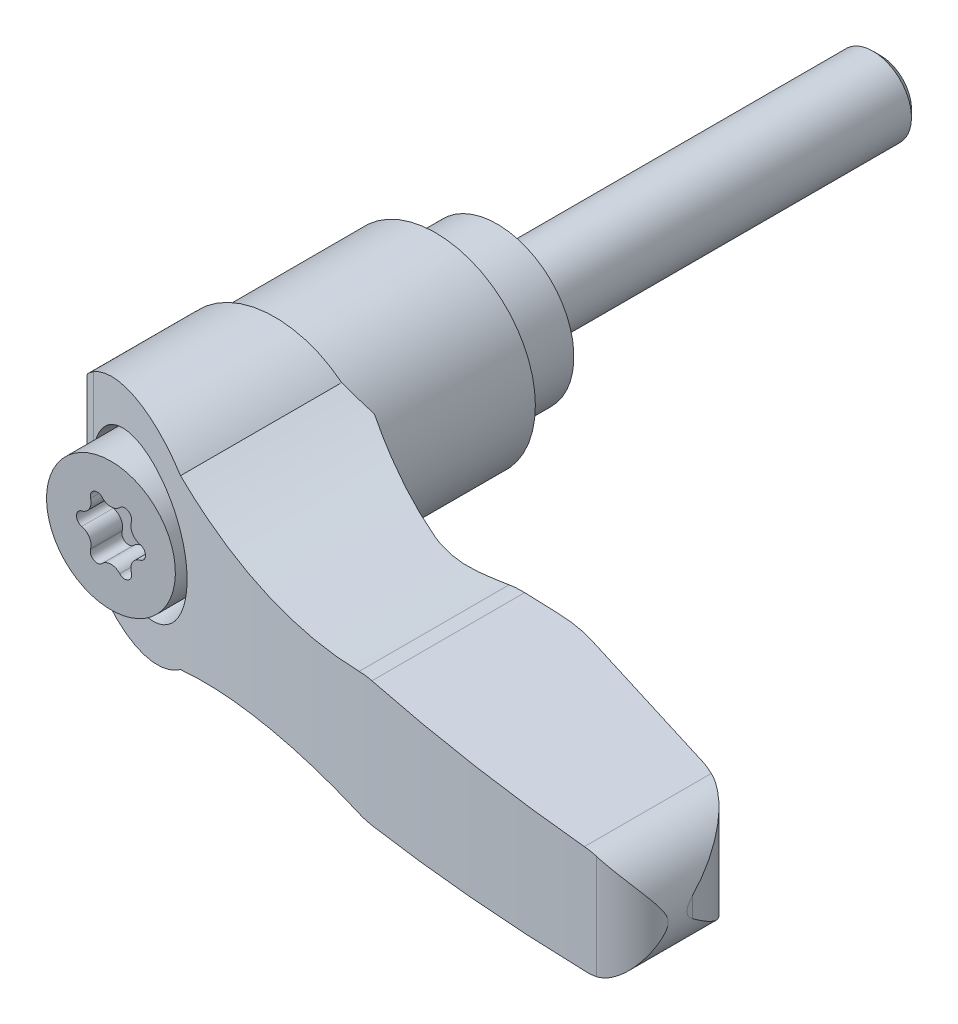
ISO-10303-21;
HEADER;
FILE_DESCRIPTION(('STEP AP214'),'2;1');
FILE_NAME('part.step','',(''),(''),'','','');
FILE_SCHEMA(('AUTOMOTIVE_DESIGN { 1 0 10303 214 1 1 1 1 }'));
ENDSEC;
DATA;
#1=APPLICATION_CONTEXT('core data for automotive mechanical design processes');
#2=APPLICATION_PROTOCOL_DEFINITION('international standard','automotive_design',2000,#1);
#3=PRODUCT_CONTEXT('',#1,'mechanical');
#4=PRODUCT('Part','Part','',(#3));
#5=PRODUCT_RELATED_PRODUCT_CATEGORY('part','',(#4));
#6=PRODUCT_DEFINITION_FORMATION('','',#4);
#7=PRODUCT_DEFINITION_CONTEXT('part definition',#1,'design');
#8=PRODUCT_DEFINITION('design','',#6,#7);
#9=PRODUCT_DEFINITION_SHAPE('','',#8);
#10=(LENGTH_UNIT() NAMED_UNIT(*) SI_UNIT(.MILLI.,.METRE.));
#11=(NAMED_UNIT(*) PLANE_ANGLE_UNIT() SI_UNIT($,.RADIAN.));
#12=(NAMED_UNIT(*) SI_UNIT($,.STERADIAN.) SOLID_ANGLE_UNIT());
#13=UNCERTAINTY_MEASURE_WITH_UNIT(LENGTH_MEASURE(1.E-05),#10,'distance_accuracy_value','');
#14=(GEOMETRIC_REPRESENTATION_CONTEXT(3) GLOBAL_UNCERTAINTY_ASSIGNED_CONTEXT((#13)) GLOBAL_UNIT_ASSIGNED_CONTEXT((#10,
#11,#12)) REPRESENTATION_CONTEXT('',''));
#15=CARTESIAN_POINT('',(0.,0.,0.));
#16=DIRECTION('',(0.,0.,1.));
#17=DIRECTION('',(1.,0.,0.));
#18=AXIS2_PLACEMENT_3D('',#15,#16,#17);
#19=CARTESIAN_POINT('',(2.008532,0.,-25.));
#20=DIRECTION('',(0.,0.,-1.));
#21=DIRECTION('',(1.,0.,0.));
#22=AXIS2_PLACEMENT_3D('',#19,#20,#21);
#23=PLANE('',#22);
#24=CARTESIAN_POINT('',(0.,0.,-25.));
#25=DIRECTION('',(0.,0.,1.));
#26=DIRECTION('',(0.,1.,0.));
#27=AXIS2_PLACEMENT_3D('',#24,#25,#26);
#28=CIRCLE('',#27,2.008532);
#29=CARTESIAN_POINT('',(0.,2.008532,-25.));
#30=VERTEX_POINT('',#29);
#31=EDGE_CURVE('E17',#30,#30,#28,.T.);
#32=ORIENTED_EDGE('',*,*,#31,.F.);
#33=EDGE_LOOP('',(#32));
#34=FACE_BOUND('',#33,.T.);
#35=ADVANCED_FACE('F14',(#34),#23,.T.);
#36=CARTESIAN_POINT('',(0.,0.,-24.508532));
#37=DIRECTION('',(0.,0.,1.));
#38=DIRECTION('',(0.,1.,0.));
#39=AXIS2_PLACEMENT_3D('',#36,#37,#38);
#40=CONICAL_SURFACE('',#39,2.5,0.785398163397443);
#41=ORIENTED_EDGE('',*,*,#31,.T.);
#42=EDGE_LOOP('',(#41));
#43=FACE_BOUND('',#42,.T.);
#44=CARTESIAN_POINT('',(0.,0.,-24.508532));
#45=DIRECTION('',(0.,0.,1.));
#46=DIRECTION('',(-1.,0.,0.));
#47=AXIS2_PLACEMENT_3D('',#44,#45,#46);
#48=CIRCLE('',#47,2.5);
#49=CARTESIAN_POINT('',(-2.5,0.,-24.508532));
#50=VERTEX_POINT('',#49);
#51=EDGE_CURVE('E283',#50,#50,#48,.T.);
#52=ORIENTED_EDGE('',*,*,#51,.F.);
#53=EDGE_LOOP('',(#52));
#54=FACE_BOUND('',#53,.T.);
#55=ADVANCED_FACE('F640',(#43,#54),#40,.T.);
#56=CARTESIAN_POINT('',(0.,0.,0.));
#57=DIRECTION('',(0.,0.,1.));
#58=DIRECTION('',(-1.,0.,0.));
#59=AXIS2_PLACEMENT_3D('',#56,#57,#58);
#60=CYLINDRICAL_SURFACE('',#59,2.5);
#61=ORIENTED_EDGE('',*,*,#51,.T.);
#62=EDGE_LOOP('',(#61));
#63=FACE_BOUND('',#62,.T.);
#64=CARTESIAN_POINT('',(0.,0.,0.));
#65=DIRECTION('',(0.,0.,1.));
#66=DIRECTION('',(-1.,0.,0.));
#67=AXIS2_PLACEMENT_3D('',#64,#65,#66);
#68=CIRCLE('',#67,2.5);
#69=CARTESIAN_POINT('',(-2.5,0.,0.));
#70=VERTEX_POINT('',#69);
#71=EDGE_CURVE('E269',#70,#70,#68,.T.);
#72=ORIENTED_EDGE('',*,*,#71,.F.);
#73=EDGE_LOOP('',(#72));
#74=FACE_BOUND('',#73,.T.);
#75=ADVANCED_FACE('F638',(#63,#74),#60,.T.);
#76=CARTESIAN_POINT('',(5.,0.,0.));
#77=DIRECTION('',(0.,0.,-1.));
#78=DIRECTION('',(1.,0.,0.));
#79=AXIS2_PLACEMENT_3D('',#76,#77,#78);
#80=PLANE('',#79);
#81=ORIENTED_EDGE('',*,*,#71,.T.);
#82=EDGE_LOOP('',(#81));
#83=FACE_BOUND('',#82,.T.);
#84=CARTESIAN_POINT('',(0.,0.,0.));
#85=DIRECTION('',(0.,0.,1.));
#86=DIRECTION('',(-1.,0.,0.));
#87=AXIS2_PLACEMENT_3D('',#84,#85,#86);
#88=CIRCLE('',#87,5.);
#89=CARTESIAN_POINT('',(-5.,0.,0.));
#90=VERTEX_POINT('',#89);
#91=EDGE_CURVE('E273',#90,#90,#88,.T.);
#92=ORIENTED_EDGE('',*,*,#91,.F.);
#93=EDGE_LOOP('',(#92));
#94=FACE_BOUND('',#93,.T.);
#95=ADVANCED_FACE('F635',(#83,#94),#80,.T.);
#96=CARTESIAN_POINT('',(0.,2.408202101,23.12));
#97=DIRECTION('',(0.,0.,-1.));
#98=DIRECTION('',(1.,0.,0.));
#99=AXIS2_PLACEMENT_3D('',#96,#97,#98);
#100=CYLINDRICAL_SURFACE('',#99,0.7875);
#101=DIRECTION('',(0.,0.,1.));
#102=VECTOR('',#101,1.);
#103=CARTESIAN_POINT('',(-0.572727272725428,1.86770259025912,24.15));
#104=LINE('',#103,#102);
#105=CARTESIAN_POINT('',(-0.572727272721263,1.86770259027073,23.12));
#106=VERTEX_POINT('',#105);
#107=CARTESIAN_POINT('',(-0.572727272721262,1.86770259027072,25.18));
#108=VERTEX_POINT('',#107);
#109=EDGE_CURVE('E281',#106,#108,#104,.T.);
#110=ORIENTED_EDGE('',*,*,#109,.F.);
#111=CARTESIAN_POINT('',(0.,2.408202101,23.12));
#112=DIRECTION('',(0.,0.,-1.));
#113=DIRECTION('',(1.,0.,0.));
#114=AXIS2_PLACEMENT_3D('',#111,#112,#113);
#115=CIRCLE('',#114,0.7875);
#116=CARTESIAN_POINT('',(0.572727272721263,1.86770259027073,23.12));
#117=VERTEX_POINT('',#116);
#118=EDGE_CURVE('E268',#106,#117,#115,.F.);
#119=ORIENTED_EDGE('',*,*,#118,.T.);
#120=DIRECTION('',(0.,0.,-1.));
#121=VECTOR('',#120,1.);
#122=CARTESIAN_POINT('',(0.572727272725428,1.86770259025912,24.15));
#123=LINE('',#122,#121);
#124=CARTESIAN_POINT('',(0.572727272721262,1.86770259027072,25.18));
#125=VERTEX_POINT('',#124);
#126=EDGE_CURVE('E250',#125,#117,#123,.T.);
#127=ORIENTED_EDGE('',*,*,#126,.F.);
#128=CARTESIAN_POINT('',(0.,2.408202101,25.18));
#129=DIRECTION('',(0.,0.,-1.));
#130=DIRECTION('',(1.,0.,0.));
#131=AXIS2_PLACEMENT_3D('',#128,#129,#130);
#132=CIRCLE('',#131,0.7875);
#133=EDGE_CURVE('E261',#125,#108,#132,.T.);
#134=ORIENTED_EDGE('',*,*,#133,.T.);
#135=EDGE_LOOP('',(#110,#119,#127,#134));
#136=FACE_BOUND('',#135,.T.);
#137=ADVANCED_FACE('F272',(#136),#100,.T.);
#138=CARTESIAN_POINT('',(0.,0.,4.55));
#139=DIRECTION('',(0.,0.,1.));
#140=DIRECTION('',(-1.,0.,0.));
#141=AXIS2_PLACEMENT_3D('',#138,#139,#140);
#142=CYLINDRICAL_SURFACE('',#141,5.);
#143=ORIENTED_EDGE('',*,*,#91,.T.);
#144=EDGE_LOOP('',(#143));
#145=FACE_BOUND('',#144,.T.);
#146=CARTESIAN_POINT('',(0.,0.,4.55));
#147=DIRECTION('',(0.,0.,-1.));
#148=DIRECTION('',(1.,0.,0.));
#149=AXIS2_PLACEMENT_3D('',#146,#147,#148);
#150=CIRCLE('',#149,5.);
#151=CARTESIAN_POINT('',(5.,0.,4.54999999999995));
#152=VERTEX_POINT('',#151);
#153=EDGE_CURVE('E621',#152,#152,#150,.F.);
#154=ORIENTED_EDGE('',*,*,#153,.F.);
#155=EDGE_LOOP('',(#154));
#156=FACE_BOUND('',#155,.T.);
#157=ADVANCED_FACE('F931',(#145,#156),#142,.T.);
#158=CARTESIAN_POINT('',(-0.9,1.558845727,25.18));
#159=DIRECTION('',(0.,0.,-1.));
#160=DIRECTION('',(0.,-1.,0.));
#161=AXIS2_PLACEMENT_3D('',#158,#159,#160);
#162=CYLINDRICAL_SURFACE('',#161,0.45);
#163=ORIENTED_EDGE('',*,*,#109,.T.);
#164=CARTESIAN_POINT('',(-0.9,1.558845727,25.18));
#165=DIRECTION('',(0.,0.,-1.));
#166=DIRECTION('',(0.,-1.,0.));
#167=AXIS2_PLACEMENT_3D('',#164,#165,#166);
#168=CIRCLE('',#167,0.45);
#169=CARTESIAN_POINT('',(-1.33111425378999,1.42984766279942,25.18));
#170=VERTEX_POINT('',#169);
#171=EDGE_CURVE('E257',#108,#170,#168,.F.);
#172=ORIENTED_EDGE('',*,*,#171,.T.);
#173=DIRECTION('',(0.,0.,1.));
#174=VECTOR('',#173,1.);
#175=CARTESIAN_POINT('',(-1.33111425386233,1.42984766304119,24.15));
#176=LINE('',#175,#174);
#177=CARTESIAN_POINT('',(-1.33111425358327,1.42984766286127,23.12));
#178=VERTEX_POINT('',#177);
#179=EDGE_CURVE('E619',#178,#170,#176,.T.);
#180=ORIENTED_EDGE('',*,*,#179,.F.);
#181=CARTESIAN_POINT('',(-0.9,1.55884572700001,23.12));
#182=DIRECTION('',(0.,0.,-1.));
#183=DIRECTION('',(0.,-1.,0.));
#184=AXIS2_PLACEMENT_3D('',#181,#182,#183);
#185=CIRCLE('',#184,0.45);
#186=EDGE_CURVE('E276',#178,#106,#185,.T.);
#187=ORIENTED_EDGE('',*,*,#186,.T.);
#188=EDGE_LOOP('',(#163,#172,#180,#187));
#189=FACE_BOUND('',#188,.T.);
#190=ADVANCED_FACE('F928',(#189),#162,.F.);
#191=CARTESIAN_POINT('',(0.9,1.558845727,25.18));
#192=DIRECTION('',(0.,0.,-1.));
#193=DIRECTION('',(0.,-1.,0.));
#194=AXIS2_PLACEMENT_3D('',#191,#192,#193);
#195=CYLINDRICAL_SURFACE('',#194,0.45);
#196=CARTESIAN_POINT('',(0.9,1.55884572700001,23.12));
#197=DIRECTION('',(0.,0.,-1.));
#198=DIRECTION('',(0.,-1.,0.));
#199=AXIS2_PLACEMENT_3D('',#196,#197,#198);
#200=CIRCLE('',#199,0.45);
#201=CARTESIAN_POINT('',(1.33111425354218,1.42984766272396,23.12));
#202=VERTEX_POINT('',#201);
#203=EDGE_CURVE('E256',#117,#202,#200,.T.);
#204=ORIENTED_EDGE('',*,*,#203,.T.);
#205=DIRECTION('',(0.,0.,-1.));
#206=VECTOR('',#205,1.);
#207=CARTESIAN_POINT('',(1.33111425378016,1.42984766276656,24.15));
#208=LINE('',#207,#206);
#209=CARTESIAN_POINT('',(1.33111425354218,1.42984766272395,25.18));
#210=VERTEX_POINT('',#209);
#211=EDGE_CURVE('E252',#210,#202,#208,.T.);
#212=ORIENTED_EDGE('',*,*,#211,.F.);
#213=CARTESIAN_POINT('',(0.9,1.558845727,25.18));
#214=DIRECTION('',(0.,0.,-1.));
#215=DIRECTION('',(0.,-1.,0.));
#216=AXIS2_PLACEMENT_3D('',#213,#214,#215);
#217=CIRCLE('',#216,0.45);
#218=EDGE_CURVE('E246',#210,#125,#217,.F.);
#219=ORIENTED_EDGE('',*,*,#218,.T.);
#220=ORIENTED_EDGE('',*,*,#126,.T.);
#221=EDGE_LOOP('',(#204,#212,#219,#220));
#222=FACE_BOUND('',#221,.T.);
#223=ADVANCED_FACE('F248',(#222),#195,.F.);
#224=CARTESIAN_POINT('',(0.,0.,4.55));
#225=DIRECTION('',(0.,0.,-1.));
#226=DIRECTION('',(1.,0.,0.));
#227=AXIS2_PLACEMENT_3D('',#224,#225,#226);
#228=CONICAL_SURFACE('',#227,5.,0.785398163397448);
#229=CARTESIAN_POINT('',(0.,0.,4.3));
#230=DIRECTION('',(0.,0.,1.));
#231=DIRECTION('',(-1.,0.,0.));
#232=AXIS2_PLACEMENT_3D('',#229,#230,#231);
#233=CIRCLE('',#232,5.25);
#234=CARTESIAN_POINT('',(-5.25,0.,4.3));
#235=VERTEX_POINT('',#234);
#236=EDGE_CURVE('E611',#235,#235,#233,.T.);
#237=ORIENTED_EDGE('',*,*,#236,.F.);
#238=EDGE_LOOP('',(#237));
#239=FACE_BOUND('',#238,.T.);
#240=ORIENTED_EDGE('',*,*,#153,.T.);
#241=EDGE_LOOP('',(#240));
#242=FACE_BOUND('',#241,.T.);
#243=ADVANCED_FACE('F922',(#239,#242),#228,.F.);
#244=CARTESIAN_POINT('',(2.085564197,1.20410105,23.12));
#245=DIRECTION('',(0.,0.,-1.));
#246=DIRECTION('',(1.,0.,0.));
#247=AXIS2_PLACEMENT_3D('',#244,#245,#246);
#248=CYLINDRICAL_SURFACE('',#247,0.7875);
#249=ORIENTED_EDGE('',*,*,#211,.T.);
#250=CARTESIAN_POINT('',(2.085564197,1.20410105,23.12));
#251=DIRECTION('',(0.,0.,-1.));
#252=DIRECTION('',(1.,0.,0.));
#253=AXIS2_PLACEMENT_3D('',#250,#251,#252);
#254=CIRCLE('',#253,0.7875);
#255=CARTESIAN_POINT('',(1.90384152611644,0.437854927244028,23.12));
#256=VERTEX_POINT('',#255);
#257=EDGE_CURVE('E617',#202,#256,#254,.F.);
#258=ORIENTED_EDGE('',*,*,#257,.T.);
#259=DIRECTION('',(0.,0.,-1.));
#260=VECTOR('',#259,1.);
#261=CARTESIAN_POINT('',(1.90384152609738,0.437854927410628,24.15));
#262=LINE('',#261,#260);
#263=CARTESIAN_POINT('',(1.90384152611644,0.437854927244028,25.18));
#264=VERTEX_POINT('',#263);
#265=EDGE_CURVE('E603',#264,#256,#262,.T.);
#266=ORIENTED_EDGE('',*,*,#265,.F.);
#267=CARTESIAN_POINT('',(2.085564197,1.20410105,25.18));
#268=DIRECTION('',(0.,0.,-1.));
#269=DIRECTION('',(1.,0.,0.));
#270=AXIS2_PLACEMENT_3D('',#267,#268,#269);
#271=CIRCLE('',#270,0.7875);
#272=EDGE_CURVE('E618',#264,#210,#271,.T.);
#273=ORIENTED_EDGE('',*,*,#272,.T.);
#274=EDGE_LOOP('',(#249,#258,#266,#273));
#275=FACE_BOUND('',#274,.T.);
#276=ADVANCED_FACE('F785',(#275),#248,.T.);
#277=CARTESIAN_POINT('',(-6.51,-14.,4.149977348));
#278=DIRECTION('',(0.707106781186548,0.,0.707106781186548));
#279=DIRECTION('',(-0.707106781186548,0.,0.707106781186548));
#280=AXIS2_PLACEMENT_3D('',#277,#278,#279);
#281=PLANE('',#280);
#282=CARTESIAN_POINT('',(-0.01,0.,-2.350022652));
#283=DIRECTION('',(0.707106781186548,0.,0.707106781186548));
#284=DIRECTION('',(0.707106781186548,0.,-0.707106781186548));
#285=AXIS2_PLACEMENT_3D('',#282,#283,#284);
#286=ELLIPSE('',#285,9.19238815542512,6.5);
#287=CARTESIAN_POINT('',(-6.360022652,-1.38824072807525,4.));
#288=VERTEX_POINT('',#287);
#289=CARTESIAN_POINT('',(-6.360022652,1.38824072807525,4.));
#290=VERTEX_POINT('',#289);
#291=EDGE_CURVE('E615',#288,#290,#286,.F.);
#292=ORIENTED_EDGE('',*,*,#291,.T.);
#293=DIRECTION('',(0.,-1.,0.));
#294=VECTOR('',#293,1.);
#295=CARTESIAN_POINT('',(-6.360022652,0.,4.));
#296=LINE('',#295,#294);
#297=EDGE_CURVE('E599',#288,#290,#296,.F.);
#298=ORIENTED_EDGE('',*,*,#297,.F.);
#299=EDGE_LOOP('',(#292,#298));
#300=FACE_BOUND('',#299,.T.);
#301=ADVANCED_FACE('F915',(#300),#281,.F.);
#302=CARTESIAN_POINT('',(0.,0.,4.));
#303=DIRECTION('',(0.,0.,1.));
#304=DIRECTION('',(-1.,0.,0.));
#305=AXIS2_PLACEMENT_3D('',#302,#303,#304);
#306=CYLINDRICAL_SURFACE('',#305,5.25);
#307=ORIENTED_EDGE('',*,*,#236,.T.);
#308=EDGE_LOOP('',(#307));
#309=FACE_BOUND('',#308,.T.);
#310=CARTESIAN_POINT('',(0.,0.,4.));
#311=DIRECTION('',(0.,0.,1.));
#312=DIRECTION('',(-1.,0.,0.));
#313=AXIS2_PLACEMENT_3D('',#310,#311,#312);
#314=CIRCLE('',#313,5.25);
#315=CARTESIAN_POINT('',(-5.25,0.,4.));
#316=VERTEX_POINT('',#315);
#317=EDGE_CURVE('E602',#316,#316,#314,.T.);
#318=ORIENTED_EDGE('',*,*,#317,.F.);
#319=EDGE_LOOP('',(#318));
#320=FACE_BOUND('',#319,.T.);
#321=ADVANCED_FACE('F911',(#309,#320),#306,.F.);
#322=CARTESIAN_POINT('',(-2.085564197,1.20410105,23.12));
#323=DIRECTION('',(0.,0.,-1.));
#324=DIRECTION('',(1.,0.,0.));
#325=AXIS2_PLACEMENT_3D('',#322,#323,#324);
#326=CYLINDRICAL_SURFACE('',#325,0.7875);
#327=DIRECTION('',(0.,0.,1.));
#328=VECTOR('',#327,1.);
#329=CARTESIAN_POINT('',(-1.90384152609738,0.437854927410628,24.15));
#330=LINE('',#329,#328);
#331=CARTESIAN_POINT('',(-1.90384152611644,0.437854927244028,23.12));
#332=VERTEX_POINT('',#331);
#333=CARTESIAN_POINT('',(-1.90384152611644,0.437854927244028,25.18));
#334=VERTEX_POINT('',#333);
#335=EDGE_CURVE('E604',#332,#334,#330,.T.);
#336=ORIENTED_EDGE('',*,*,#335,.F.);
#337=CARTESIAN_POINT('',(-2.085564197,1.20410105,23.12));
#338=DIRECTION('',(0.,0.,-1.));
#339=DIRECTION('',(1.,0.,0.));
#340=AXIS2_PLACEMENT_3D('',#337,#338,#339);
#341=CIRCLE('',#340,0.7875);
#342=EDGE_CURVE('E610',#332,#178,#341,.F.);
#343=ORIENTED_EDGE('',*,*,#342,.T.);
#344=ORIENTED_EDGE('',*,*,#179,.T.);
#345=CARTESIAN_POINT('',(-2.085564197,1.20410105,25.18));
#346=DIRECTION('',(0.,0.,-1.));
#347=DIRECTION('',(1.,0.,0.));
#348=AXIS2_PLACEMENT_3D('',#345,#346,#347);
#349=CIRCLE('',#348,0.7875);
#350=EDGE_CURVE('E614',#170,#334,#349,.T.);
#351=ORIENTED_EDGE('',*,*,#350,.T.);
#352=EDGE_LOOP('',(#336,#343,#344,#351));
#353=FACE_BOUND('',#352,.T.);
#354=ADVANCED_FACE('F907',(#353),#326,.T.);
#355=CARTESIAN_POINT('',(-0.01,0.,4.));
#356=DIRECTION('',(0.,0.,-1.));
#357=DIRECTION('',(1.,0.,0.));
#358=AXIS2_PLACEMENT_3D('',#355,#356,#357);
#359=PLANE('',#358);
#360=ORIENTED_EDGE('',*,*,#317,.T.);
#361=EDGE_LOOP('',(#360));
#362=FACE_BOUND('',#361,.T.);
#363=ORIENTED_EDGE('',*,*,#297,.T.);
#364=CARTESIAN_POINT('',(-0.01,0.,4.));
#365=DIRECTION('',(0.,0.,-1.));
#366=DIRECTION('',(1.,0.,0.));
#367=AXIS2_PLACEMENT_3D('',#364,#365,#366);
#368=CIRCLE('',#367,6.5);
#369=EDGE_CURVE('E766',#288,#290,#368,.F.);
#370=ORIENTED_EDGE('',*,*,#369,.F.);
#371=EDGE_LOOP('',(#363,#370));
#372=FACE_BOUND('',#371,.T.);
#373=ADVANCED_FACE('F903',(#362,#372),#359,.T.);
#374=CARTESIAN_POINT('',(-1.8,0.,25.18));
#375=DIRECTION('',(0.,0.,-1.));
#376=DIRECTION('',(0.,-1.,0.));
#377=AXIS2_PLACEMENT_3D('',#374,#375,#376);
#378=CYLINDRICAL_SURFACE('',#377,0.45);
#379=DIRECTION('',(0.,0.,1.));
#380=VECTOR('',#379,1.);
#381=CARTESIAN_POINT('',(-1.9038415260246,-0.437854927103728,24.15));
#382=LINE('',#381,#380);
#383=CARTESIAN_POINT('',(-1.90384152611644,-0.437854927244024,23.12));
#384=VERTEX_POINT('',#383);
#385=CARTESIAN_POINT('',(-1.90384152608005,-0.437854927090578,25.18));
#386=VERTEX_POINT('',#385);
#387=EDGE_CURVE('E590',#384,#386,#382,.T.);
#388=ORIENTED_EDGE('',*,*,#387,.F.);
#389=CARTESIAN_POINT('',(-1.8,0.,23.12));
#390=DIRECTION('',(0.,0.,-1.));
#391=DIRECTION('',(0.,-1.,0.));
#392=AXIS2_PLACEMENT_3D('',#389,#390,#391);
#393=CIRCLE('',#392,0.45);
#394=EDGE_CURVE('E772',#384,#332,#393,.T.);
#395=ORIENTED_EDGE('',*,*,#394,.T.);
#396=ORIENTED_EDGE('',*,*,#335,.T.);
#397=CARTESIAN_POINT('',(-1.8,0.,25.18));
#398=DIRECTION('',(0.,0.,-1.));
#399=DIRECTION('',(0.,-1.,0.));
#400=AXIS2_PLACEMENT_3D('',#397,#398,#399);
#401=CIRCLE('',#400,0.45);
#402=EDGE_CURVE('E607',#334,#386,#401,.F.);
#403=ORIENTED_EDGE('',*,*,#402,.T.);
#404=EDGE_LOOP('',(#388,#395,#396,#403));
#405=FACE_BOUND('',#404,.T.);
#406=ADVANCED_FACE('F900',(#405),#378,.F.);
#407=CARTESIAN_POINT('',(1.8,0.,25.18));
#408=DIRECTION('',(0.,0.,-1.));
#409=DIRECTION('',(0.,-1.,0.));
#410=AXIS2_PLACEMENT_3D('',#407,#408,#409);
#411=CYLINDRICAL_SURFACE('',#410,0.45);
#412=CARTESIAN_POINT('',(1.8,0.,23.12));
#413=DIRECTION('',(0.,0.,-1.));
#414=DIRECTION('',(0.,-1.,0.));
#415=AXIS2_PLACEMENT_3D('',#412,#413,#414);
#416=CIRCLE('',#415,0.45);
#417=CARTESIAN_POINT('',(1.90384152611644,-0.437854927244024,23.12));
#418=VERTEX_POINT('',#417);
#419=EDGE_CURVE('E768',#256,#418,#416,.T.);
#420=ORIENTED_EDGE('',*,*,#419,.T.);
#421=DIRECTION('',(0.,0.,-1.));
#422=VECTOR('',#421,1.);
#423=CARTESIAN_POINT('',(1.9038415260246,-0.437854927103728,24.15));
#424=LINE('',#423,#422);
#425=CARTESIAN_POINT('',(1.90384152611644,-0.437854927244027,25.18));
#426=VERTEX_POINT('',#425);
#427=EDGE_CURVE('E592',#426,#418,#424,.T.);
#428=ORIENTED_EDGE('',*,*,#427,.F.);
#429=CARTESIAN_POINT('',(1.8,0.,25.18));
#430=DIRECTION('',(0.,0.,-1.));
#431=DIRECTION('',(0.,-1.,0.));
#432=AXIS2_PLACEMENT_3D('',#429,#430,#431);
#433=CIRCLE('',#432,0.45);
#434=EDGE_CURVE('E770',#426,#264,#433,.F.);
#435=ORIENTED_EDGE('',*,*,#434,.T.);
#436=ORIENTED_EDGE('',*,*,#265,.T.);
#437=EDGE_LOOP('',(#420,#428,#435,#436));
#438=FACE_BOUND('',#437,.T.);
#439=ADVANCED_FACE('F788',(#438),#411,.F.);
#440=CARTESIAN_POINT('',(-0.01,0.,4.));
#441=DIRECTION('',(0.,0.,-1.));
#442=DIRECTION('',(1.,0.,0.));
#443=AXIS2_PLACEMENT_3D('',#440,#441,#442);
#444=CYLINDRICAL_SURFACE('',#443,6.5);
#445=ORIENTED_EDGE('',*,*,#291,.F.);
#446=ORIENTED_EDGE('',*,*,#369,.T.);
#447=EDGE_LOOP('',(#445,#446));
#448=FACE_BOUND('',#447,.T.);
#449=CARTESIAN_POINT('',(-0.01,0.,14.5));
#450=DIRECTION('',(0.,0.,-1.));
#451=DIRECTION('',(1.,0.,0.));
#452=AXIS2_PLACEMENT_3D('',#449,#450,#451);
#453=CIRCLE('',#452,6.5);
#454=CARTESIAN_POINT('',(-6.51,0.,14.5));
#455=VERTEX_POINT('',#454);
#456=CARTESIAN_POINT('',(6.48999999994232,0.,14.5000000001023));
#457=VERTEX_POINT('',#456);
#458=EDGE_CURVE('E563',#455,#457,#453,.F.);
#459=ORIENTED_EDGE('',*,*,#458,.F.);
#460=CARTESIAN_POINT('',(-0.01,0.,14.5));
#461=DIRECTION('',(0.,0.,-1.));
#462=DIRECTION('',(1.,0.,0.));
#463=AXIS2_PLACEMENT_3D('',#460,#461,#462);
#464=CIRCLE('',#463,6.5);
#465=EDGE_CURVE('E579',#457,#455,#464,.F.);
#466=ORIENTED_EDGE('',*,*,#465,.F.);
#467=EDGE_LOOP('',(#459,#466));
#468=FACE_BOUND('',#467,.T.);
#469=ADVANCED_FACE('F893',(#448,#468),#444,.T.);
#470=CARTESIAN_POINT('',(39.938965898,-8.,27.204249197));
#471=DIRECTION('',(-0.989626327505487,0.,0.143665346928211));
#472=DIRECTION('',(-0.143665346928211,0.,-0.989626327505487));
#473=AXIS2_PLACEMENT_3D('',#470,#471,#472);
#474=PLANE('',#473);
#475=CARTESIAN_POINT('',(36.5,0.,3.51522978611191));
#476=DIRECTION('',(-0.989626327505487,0.,0.143665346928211));
#477=DIRECTION('',(0.143665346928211,0.,0.989626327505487));
#478=AXIS2_PLACEMENT_3D('',#475,#476,#477);
#479=ELLIPSE('',#478,24.3621727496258,3.5);
#480=CARTESIAN_POINT('',(39.9389658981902,-0.650779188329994,27.2042491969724));
#481=VERTEX_POINT('',#480);
#482=CARTESIAN_POINT('',(39.938965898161,0.650779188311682,27.2042491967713));
#483=VERTEX_POINT('',#482);
#484=EDGE_CURVE('E877',#481,#483,#479,.T.);
#485=ORIENTED_EDGE('',*,*,#484,.F.);
#486=DIRECTION('',(0.,-1.,0.));
#487=VECTOR('',#486,1.);
#488=CARTESIAN_POINT('',(39.9389658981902,9.99999996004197E-10,27.2042491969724));
#489=LINE('',#488,#487);
#490=EDGE_CURVE('E583',#483,#481,#489,.T.);
#491=ORIENTED_EDGE('',*,*,#490,.F.);
#492=EDGE_LOOP('',(#485,#491));
#493=FACE_BOUND('',#492,.T.);
#494=ADVANCED_FACE('F887',(#493),#474,.F.);
#495=CARTESIAN_POINT('',(33.862660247,3.57817111,28.086354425));
#496=DIRECTION('',(0.,1.,0.));
#497=DIRECTION('',(0.,0.,-1.));
#498=AXIS2_PLACEMENT_3D('',#495,#496,#497);
#499=CYLINDRICAL_SURFACE('',#498,6.14);
#500=ORIENTED_EDGE('',*,*,#490,.T.);
#501=CARTESIAN_POINT('',(36.500000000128,-3.5,22.5416236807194));
#502=CARTESIAN_POINT('',(36.6061539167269,-3.50000941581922,22.5920863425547));
#503=CARTESIAN_POINT('',(36.7107657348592,-3.49517280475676,22.6456099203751));
#504=CARTESIAN_POINT('',(36.9160027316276,-3.47671082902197,22.7581011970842));
#505=CARTESIAN_POINT('',(37.0166343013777,-3.46310021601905,22.8170596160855));
#506=CARTESIAN_POINT('',(37.2123479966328,-3.42816986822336,22.9392782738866));
#507=CARTESIAN_POINT('',(37.3074768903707,-3.40693163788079,23.0024874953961));
#508=CARTESIAN_POINT('',(37.492922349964,-3.35757592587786,23.1332068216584));
#509=CARTESIAN_POINT('',(37.5832363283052,-3.3294547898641,23.2007191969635));
#510=CARTESIAN_POINT('',(37.7830795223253,-3.25850520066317,23.3587409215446));
#511=CARTESIAN_POINT('',(37.89099272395,-3.21376078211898,23.4504360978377));
#512=CARTESIAN_POINT('',(38.0982482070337,-3.11588681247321,23.6389903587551));
#513=CARTESIAN_POINT('',(38.1975840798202,-3.06275107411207,23.7358532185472));
#514=CARTESIAN_POINT('',(38.3880468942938,-2.9491746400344,23.9343090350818));
#515=CARTESIAN_POINT('',(38.4791322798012,-2.88870020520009,24.0359224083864));
#516=CARTESIAN_POINT('',(38.6526412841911,-2.76182607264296,24.2426721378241));
#517=CARTESIAN_POINT('',(38.7350674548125,-2.69542813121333,24.3478074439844));
#518=CARTESIAN_POINT('',(38.9229341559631,-2.52996933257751,24.60388561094));
#519=CARTESIAN_POINT('',(39.0243159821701,-2.4285034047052,24.7562617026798));
#520=CARTESIAN_POINT('',(39.211170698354,-2.21796613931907,25.0654781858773));
#521=CARTESIAN_POINT('',(39.2966363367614,-2.10889136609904,25.2223205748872));
#522=CARTESIAN_POINT('',(39.4522229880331,-1.88493092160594,25.5392893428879));
#523=CARTESIAN_POINT('',(39.5223498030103,-1.77004746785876,25.69941445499));
#524=CARTESIAN_POINT('',(39.6478320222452,-1.53583460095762,26.0220530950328));
#525=CARTESIAN_POINT('',(39.7031929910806,-1.41650688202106,26.1845656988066));
#526=CARTESIAN_POINT('',(39.7933776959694,-1.19018579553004,26.4900634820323));
#527=CARTESIAN_POINT('',(39.8299343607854,-1.08360162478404,26.6328455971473));
#528=CARTESIAN_POINT('',(39.8923391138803,-0.868586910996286,26.9185049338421));
#529=CARTESIAN_POINT('',(39.9182264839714,-0.760164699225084,27.0613798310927));
#530=CARTESIAN_POINT('',(39.9389658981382,-0.650779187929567,27.2042491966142));
#531=B_SPLINE_CURVE_WITH_KNOTS('',3,(#501,#502,#503,#504,#505,#506,#507,#508,#509,#510,#511,
#512,#513,#514,#515,#516,#517,#518,#519,#520,#521,#522,#523,#524,#525,#526,#527,#528,#529,#530),
.UNSPECIFIED.,.F.,.F.,(4,2,2,2,2,2,2,2,2,2,2,2,2,2,4),(0.,0.35235052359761,0.70411018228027,
1.0522178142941,1.40051067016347,1.8453815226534,2.29058194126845,2.73791274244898,
3.18511135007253,3.81198117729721,4.43913591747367,5.06605301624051,5.69273352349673,
6.23807905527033,6.78139842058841),.UNSPECIFIED.);
#532=CARTESIAN_POINT('',(36.5000000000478,-3.49999999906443,22.5416236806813));
#533=VERTEX_POINT('',#532);
#534=EDGE_CURVE('E875',#533,#481,#531,.T.);
#535=ORIENTED_EDGE('',*,*,#534,.F.);
#536=CARTESIAN_POINT('',(33.862660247,-3.59762871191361,28.086354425));
#537=DIRECTION('',(0.0369925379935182,-0.999315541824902,0.));
#538=DIRECTION('',(0.999315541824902,0.0369925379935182,0.));
#539=AXIS2_PLACEMENT_3D('',#536,#537,#538);
#540=ELLIPSE('',#539,6.14420545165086,6.14);
#541=CARTESIAN_POINT('',(35.5344609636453,-3.53574220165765,22.1783359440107));
#542=VERTEX_POINT('',#541);
#543=EDGE_CURVE('E764',#533,#542,#540,.F.);
#544=ORIENTED_EDGE('',*,*,#543,.T.);
#545=DIRECTION('',(0.,-1.,0.));
#546=VECTOR('',#545,1.);
#547=CARTESIAN_POINT('',(35.5344609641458,-8.,22.1783359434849));
#548=LINE('',#547,#546);
#549=CARTESIAN_POINT('',(35.5344609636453,3.53574220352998,22.1783359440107));
#550=VERTEX_POINT('',#549);
#551=EDGE_CURVE('E545',#550,#542,#548,.T.);
#552=ORIENTED_EDGE('',*,*,#551,.F.);
#553=CARTESIAN_POINT('',(33.862660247,3.59762871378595,28.086354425));
#554=DIRECTION('',(0.0369925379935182,0.999315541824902,0.));
#555=DIRECTION('',(-0.999315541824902,0.0369925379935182,0.));
#556=AXIS2_PLACEMENT_3D('',#553,#554,#555);
#557=ELLIPSE('',#556,6.14420545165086,6.14);
#558=CARTESIAN_POINT('',(36.5000000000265,3.5,22.5416236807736));
#559=VERTEX_POINT('',#558);
#560=EDGE_CURVE('E591',#550,#559,#557,.F.);
#561=ORIENTED_EDGE('',*,*,#560,.T.);
#562=CARTESIAN_POINT('',(39.938965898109,0.650779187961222,27.2042491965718));
#563=CARTESIAN_POINT('',(39.9247028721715,0.726086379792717,27.1059853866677));
#564=CARTESIAN_POINT('',(39.9079968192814,0.800887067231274,27.0076860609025));
#565=CARTESIAN_POINT('',(39.86963472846,0.94945878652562,26.8112602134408));
#566=CARTESIAN_POINT('',(39.8479781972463,1.02322971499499,26.7131337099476));
#567=CARTESIAN_POINT('',(39.7995979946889,1.16988012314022,26.5170899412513));
#568=CARTESIAN_POINT('',(39.7728626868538,1.24275713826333,26.4191736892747));
#569=CARTESIAN_POINT('',(39.7142815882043,1.38725410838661,26.2239599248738));
#570=CARTESIAN_POINT('',(39.6824358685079,1.45887408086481,26.1266624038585));
#571=CARTESIAN_POINT('',(39.5782917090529,1.67318502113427,25.8337016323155));
#572=CARTESIAN_POINT('',(39.4979263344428,1.81366367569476,25.6391889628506));
#573=CARTESIAN_POINT('',(39.3150854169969,2.0861945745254,25.2551202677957));
#574=CARTESIAN_POINT('',(39.2126344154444,2.21825596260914,25.0655590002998));
#575=CARTESIAN_POINT('',(38.959502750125,2.49877334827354,24.6523338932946));
#576=CARTESIAN_POINT('',(38.8031801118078,2.64456339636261,24.430201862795));
#577=CARTESIAN_POINT('',(38.5417124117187,2.84488994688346,24.1082756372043));
#578=CARTESIAN_POINT('',(38.4501831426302,2.90854134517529,24.0029632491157));
#579=CARTESIAN_POINT('',(38.2579442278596,3.02861213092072,23.7967186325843));
#580=CARTESIAN_POINT('',(38.1572360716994,3.08503268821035,23.6957856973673));
#581=CARTESIAN_POINT('',(37.8892625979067,3.21757634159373,23.445732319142));
#582=CARTESIAN_POINT('',(37.7155213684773,3.28779061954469,23.3001643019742));
#583=CARTESIAN_POINT('',(37.439699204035,3.37286339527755,23.0946053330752));
#584=CARTESIAN_POINT('',(37.3453175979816,3.39783246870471,23.0282732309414));
#585=CARTESIAN_POINT('',(37.1517842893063,3.44019984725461,22.9003457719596));
#586=CARTESIAN_POINT('',(37.0526354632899,3.45760265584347,22.8387476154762));
#587=CARTESIAN_POINT('',(36.8781783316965,3.48029211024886,22.7372021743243));
#588=CARTESIAN_POINT('',(36.8038676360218,3.48759914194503,22.6959814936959));
#589=CARTESIAN_POINT('',(36.6533047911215,3.49745586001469,22.616512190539));
#590=CARTESIAN_POINT('',(36.5770513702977,3.50000234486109,22.578265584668));
#591=CARTESIAN_POINT('',(36.5000000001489,3.5,22.5416236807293));
#592=B_SPLINE_CURVE_WITH_KNOTS('',3,(#562,#563,#564,#565,#566,#567,#568,#569,#570,#571,#572,
#573,#574,#575,#576,#577,#578,#579,#580,#581,#582,#583,#584,#585,#586,#587,#588,#589,#590,#591),
.UNSPECIFIED.,.F.,.F.,(4,2,2,2,2,2,2,2,2,2,2,2,2,2,4),(0.,0.373839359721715,0.747715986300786,
1.12245980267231,1.49719840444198,2.25512351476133,3.01221072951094,3.93367725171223,
4.39332639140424,4.85290107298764,5.56171222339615,5.91546494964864,6.26900683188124,
6.52468766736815,6.78054038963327),.UNSPECIFIED.);
#593=EDGE_CURVE('E401',#483,#559,#592,.T.);
#594=ORIENTED_EDGE('',*,*,#593,.F.);
#595=EDGE_LOOP('',(#500,#535,#544,#552,#561,#594));
#596=FACE_BOUND('',#595,.T.);
#597=ADVANCED_FACE('F882',(#596),#499,.T.);
#598=CARTESIAN_POINT('',(2.085564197,-1.20410105,23.12));
#599=DIRECTION('',(0.,0.,-1.));
#600=DIRECTION('',(1.,0.,0.));
#601=AXIS2_PLACEMENT_3D('',#598,#599,#600);
#602=CYLINDRICAL_SURFACE('',#601,0.7875);
#603=ORIENTED_EDGE('',*,*,#427,.T.);
#604=CARTESIAN_POINT('',(2.085564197,-1.20410105,23.12));
#605=DIRECTION('',(0.,0.,-1.));
#606=DIRECTION('',(1.,0.,0.));
#607=AXIS2_PLACEMENT_3D('',#604,#605,#606);
#608=CIRCLE('',#607,0.7875);
#609=CARTESIAN_POINT('',(1.33111425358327,-1.42984766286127,23.12));
#610=VERTEX_POINT('',#609);
#611=EDGE_CURVE('E595',#418,#610,#608,.F.);
#612=ORIENTED_EDGE('',*,*,#611,.T.);
#613=DIRECTION('',(0.,0.,-1.));
#614=VECTOR('',#613,1.);
#615=CARTESIAN_POINT('',(1.33111425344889,-1.4298476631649,24.15));
#616=LINE('',#615,#614);
#617=CARTESIAN_POINT('',(1.33111425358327,-1.42984766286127,25.18));
#618=VERTEX_POINT('',#617);
#619=EDGE_CURVE('E529',#618,#610,#616,.T.);
#620=ORIENTED_EDGE('',*,*,#619,.F.);
#621=CARTESIAN_POINT('',(2.085564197,-1.20410105,25.18));
#622=DIRECTION('',(0.,0.,-1.));
#623=DIRECTION('',(1.,0.,0.));
#624=AXIS2_PLACEMENT_3D('',#621,#622,#623);
#625=CIRCLE('',#624,0.7875);
#626=EDGE_CURVE('E596',#618,#426,#625,.T.);
#627=ORIENTED_EDGE('',*,*,#626,.T.);
#628=EDGE_LOOP('',(#603,#612,#620,#627));
#629=FACE_BOUND('',#628,.T.);
#630=ADVANCED_FACE('F796',(#629),#602,.T.);
#631=CARTESIAN_POINT('',(-6.51,-8.,14.5));
#632=DIRECTION('',(0.,0.,1.));
#633=DIRECTION('',(-1.,0.,0.));
#634=AXIS2_PLACEMENT_3D('',#631,#632,#633);
#635=PLANE('',#634);
#636=DIRECTION('',(0.,1.,0.));
#637=VECTOR('',#636,1.);
#638=CARTESIAN_POINT('',(6.48999999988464,0.,14.5000000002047));
#639=LINE('',#638,#637);
#640=CARTESIAN_POINT('',(6.48999999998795,4.77390244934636,14.5000000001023));
#641=VERTEX_POINT('',#640);
#642=EDGE_CURVE('E559',#457,#641,#639,.T.);
#643=ORIENTED_EDGE('',*,*,#642,.F.);
#644=ORIENTED_EDGE('',*,*,#465,.T.);
#645=DIRECTION('',(0.,-1.,0.));
#646=VECTOR('',#645,1.);
#647=CARTESIAN_POINT('',(-6.51,-8.,14.5));
#648=LINE('',#647,#646);
#649=CARTESIAN_POINT('',(-6.50999999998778,2.57291663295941,14.5));
#650=VERTEX_POINT('',#649);
#651=EDGE_CURVE('E576',#650,#455,#648,.T.);
#652=ORIENTED_EDGE('',*,*,#651,.F.);
#653=CARTESIAN_POINT('',(0.,0.,14.5));
#654=DIRECTION('',(0.,0.,1.));
#655=DIRECTION('',(-1.,0.,0.));
#656=AXIS2_PLACEMENT_3D('',#653,#654,#655);
#657=CIRCLE('',#656,7.);
#658=CARTESIAN_POINT('',(4.36278582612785,5.47413005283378,14.5));
#659=VERTEX_POINT('',#658);
#660=EDGE_CURVE('E575',#659,#650,#657,.T.);
#661=ORIENTED_EDGE('',*,*,#660,.F.);
#662=CARTESIAN_POINT('',(14.8,33.6,14.5));
#663=DIRECTION('',(0.,0.,1.));
#664=DIRECTION('',(-1.,0.,0.));
#665=AXIS2_PLACEMENT_3D('',#662,#663,#664);
#666=CIRCLE('',#665,30.);
#667=EDGE_CURVE('E855',#641,#659,#666,.F.);
#668=ORIENTED_EDGE('',*,*,#667,.F.);
#669=EDGE_LOOP('',(#643,#644,#652,#661,#668));
#670=FACE_BOUND('',#669,.T.);
#671=ADVANCED_FACE('F864',(#670),#635,.F.);
#672=CARTESIAN_POINT('',(-6.51,-8.,18.787325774));
#673=DIRECTION('',(1.,0.,0.));
#674=DIRECTION('',(0.,0.,1.));
#675=AXIS2_PLACEMENT_3D('',#672,#673,#674);
#676=PLANE('',#675);
#677=ORIENTED_EDGE('',*,*,#651,.T.);
#678=DIRECTION('',(0.,-1.,0.));
#679=VECTOR('',#678,1.);
#680=CARTESIAN_POINT('',(-6.51,-8.,14.5));
#681=LINE('',#680,#679);
#682=CARTESIAN_POINT('',(-6.50999999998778,-2.5729166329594,14.5));
#683=VERTEX_POINT('',#682);
#684=EDGE_CURVE('E560',#683,#455,#681,.F.);
#685=ORIENTED_EDGE('',*,*,#684,.F.);
#686=DIRECTION('',(0.,0.,-1.));
#687=VECTOR('',#686,1.);
#688=CARTESIAN_POINT('',(-6.50999999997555,-2.57291663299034,19.7858103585));
#689=LINE('',#688,#687);
#690=CARTESIAN_POINT('',(-6.50999999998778,-2.57291663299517,18.787325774));
#691=VERTEX_POINT('',#690);
#692=EDGE_CURVE('E564',#691,#683,#689,.T.);
#693=ORIENTED_EDGE('',*,*,#692,.F.);
#694=DIRECTION('',(0.,-1.,0.));
#695=VECTOR('',#694,1.);
#696=CARTESIAN_POINT('',(-6.51,-5.00000214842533E-10,18.787325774));
#697=LINE('',#696,#695);
#698=CARTESIAN_POINT('',(-6.50999999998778,2.57291663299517,18.787325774));
#699=VERTEX_POINT('',#698);
#700=EDGE_CURVE('E569',#699,#691,#697,.T.);
#701=ORIENTED_EDGE('',*,*,#700,.F.);
#702=DIRECTION('',(0.,0.,1.));
#703=VECTOR('',#702,1.);
#704=CARTESIAN_POINT('',(-6.50999999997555,2.57291663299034,19.7858103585));
#705=LINE('',#704,#703);
#706=EDGE_CURVE('E572',#650,#699,#705,.T.);
#707=ORIENTED_EDGE('',*,*,#706,.F.);
#708=EDGE_LOOP('',(#677,#685,#693,#701,#707));
#709=FACE_BOUND('',#708,.T.);
#710=ADVANCED_FACE('F1030',(#709),#676,.F.);
#711=CARTESIAN_POINT('',(-6.51,-8.,14.5));
#712=DIRECTION('',(0.,0.,1.));
#713=DIRECTION('',(-1.,0.,0.));
#714=AXIS2_PLACEMENT_3D('',#711,#712,#713);
#715=PLANE('',#714);
#716=CARTESIAN_POINT('',(0.,0.,14.5));
#717=DIRECTION('',(0.,0.,1.));
#718=DIRECTION('',(-1.,0.,0.));
#719=AXIS2_PLACEMENT_3D('',#716,#717,#718);
#720=CIRCLE('',#719,7.);
#721=CARTESIAN_POINT('',(4.3627858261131,-5.47413005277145,14.5000000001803));
#722=VERTEX_POINT('',#721);
#723=EDGE_CURVE('E567',#683,#722,#720,.T.);
#724=ORIENTED_EDGE('',*,*,#723,.F.);
#725=ORIENTED_EDGE('',*,*,#684,.T.);
#726=ORIENTED_EDGE('',*,*,#458,.T.);
#727=DIRECTION('',(0.,1.,0.));
#728=VECTOR('',#727,1.);
#729=CARTESIAN_POINT('',(6.48999999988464,0.,14.5000000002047));
#730=LINE('',#729,#728);
#731=CARTESIAN_POINT('',(6.4899999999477,-4.77390244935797,14.5000000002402));
#732=VERTEX_POINT('',#731);
#733=EDGE_CURVE('E556',#732,#457,#730,.T.);
#734=ORIENTED_EDGE('',*,*,#733,.F.);
#735=CARTESIAN_POINT('',(14.8,-33.6,14.5000000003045));
#736=DIRECTION('',(0.,0.,1.));
#737=DIRECTION('',(-1.,0.,0.));
#738=AXIS2_PLACEMENT_3D('',#735,#736,#737);
#739=CIRCLE('',#738,30.);
#740=EDGE_CURVE('E733',#722,#732,#739,.F.);
#741=ORIENTED_EDGE('',*,*,#740,.F.);
#742=EDGE_LOOP('',(#724,#725,#726,#734,#741));
#743=FACE_BOUND('',#742,.T.);
#744=ADVANCED_FACE('F1037',(#743),#715,.F.);
#745=CARTESIAN_POINT('',(42.828934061,-4.831189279,-49.963027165));
#746=DIRECTION('',(0.,1.,0.));
#747=DIRECTION('',(0.,0.,-1.));
#748=AXIS2_PLACEMENT_3D('',#745,#746,#747);
#749=CYLINDRICAL_SURFACE('',#748,74.);
#750=CARTESIAN_POINT('',(6.49000000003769,-4.7739024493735,14.5000000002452));
#751=CARTESIAN_POINT('',(7.10709183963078,-4.59600017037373,14.8479114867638));
#752=CARTESIAN_POINT('',(7.73340291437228,-4.43691869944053,15.1892512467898));
#753=CARTESIAN_POINT('',(8.99990836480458,-4.1589148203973,15.8557045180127));
#754=CARTESIAN_POINT('',(9.64003521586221,-4.03983028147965,16.1808788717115));
#755=CARTESIAN_POINT('',(10.9347595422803,-3.84283944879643,16.8148240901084));
#756=CARTESIAN_POINT('',(11.5893580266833,-3.76493603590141,17.1235938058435));
#757=CARTESIAN_POINT('',(12.581425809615,-3.68029491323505,17.5737847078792));
#758=CARTESIAN_POINT('',(12.9145226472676,-3.65743626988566,17.7219861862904));
#759=CARTESIAN_POINT('',(13.5833701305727,-3.62280963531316,18.0136612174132));
#760=CARTESIAN_POINT('',(13.9191209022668,-3.61104217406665,18.1571345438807));
#761=CARTESIAN_POINT('',(14.256035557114,-3.60493202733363,18.2981585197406));
#762=B_SPLINE_CURVE_WITH_KNOTS('',3,(#750,#751,#752,#753,#754,#755,#756,#757,#758,#759,#760,
#761),.UNSPECIFIED.,.F.,.F.,(4,2,2,2,2,4),(0.,2.19098662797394,4.37298159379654,
6.55512918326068,7.65082961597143,8.74658240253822),.UNSPECIFIED.);
#763=CARTESIAN_POINT('',(14.2560355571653,-3.60493202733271,18.2981585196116));
#764=VERTEX_POINT('',#763);
#765=EDGE_CURVE('E459',#732,#764,#762,.T.);
#766=ORIENTED_EDGE('',*,*,#765,.F.);
#767=ORIENTED_EDGE('',*,*,#733,.T.);
#768=ORIENTED_EDGE('',*,*,#642,.T.);
#769=CARTESIAN_POINT('',(14.2560355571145,3.60493202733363,18.2981585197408));
#770=CARTESIAN_POINT('',(13.9191209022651,3.61104217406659,18.1571345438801));
#771=CARTESIAN_POINT('',(13.5833701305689,3.62280963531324,18.0136612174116));
#772=CARTESIAN_POINT('',(12.9145226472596,3.65743626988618,17.7219861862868));
#773=CARTESIAN_POINT('',(12.5814258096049,3.68029491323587,17.5737847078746));
#774=CARTESIAN_POINT('',(11.5893580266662,3.76493603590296,17.1235938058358));
#775=CARTESIAN_POINT('',(10.9347595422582,3.84283944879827,16.814824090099));
#776=CARTESIAN_POINT('',(9.64003521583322,4.03983028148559,16.1808788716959));
#777=CARTESIAN_POINT('',(8.9999083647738,4.15891482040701,15.8557045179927));
#778=CARTESIAN_POINT('',(7.73340291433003,4.43691869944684,15.1892512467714));
#779=CARTESIAN_POINT('',(7.10709183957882,4.5960001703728,14.8479114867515));
#780=CARTESIAN_POINT('',(6.4899999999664,4.77390244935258,14.5000000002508));
#781=B_SPLINE_CURVE_WITH_KNOTS('',3,(#769,#770,#771,#772,#773,#774,#775,#776,#777,#778,#779,
#780),.UNSPECIFIED.,.F.,.F.,(4,2,2,2,2,4),(0.,1.09575278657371,2.19145321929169,
4.37360080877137,6.55559577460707,8.74658240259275),.UNSPECIFIED.);
#782=CARTESIAN_POINT('',(14.2560355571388,3.60493202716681,18.2981585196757));
#783=VERTEX_POINT('',#782);
#784=EDGE_CURVE('E498',#783,#641,#781,.T.);
#785=ORIENTED_EDGE('',*,*,#784,.F.);
#786=DIRECTION('',(0.,1.,0.));
#787=VECTOR('',#786,1.);
#788=CARTESIAN_POINT('',(14.256035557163,0.,18.2981585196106));
#789=LINE('',#788,#787);
#790=EDGE_CURVE('E554',#764,#783,#789,.T.);
#791=ORIENTED_EDGE('',*,*,#790,.F.);
#792=EDGE_LOOP('',(#766,#767,#768,#785,#791));
#793=FACE_BOUND('',#792,.T.);
#794=ADVANCED_FACE('F480',(#793),#749,.F.);
#795=CARTESIAN_POINT('',(17.75042382,-3.790381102,9.95));
#796=DIRECTION('',(0.,1.,0.));
#797=DIRECTION('',(0.,0.,-1.));
#798=AXIS2_PLACEMENT_3D('',#795,#796,#797);
#799=CYLINDRICAL_SURFACE('',#798,9.05);
#800=DIRECTION('',(0.,-1.,0.));
#801=VECTOR('',#800,1.);
#802=CARTESIAN_POINT('',(17.75042382,-8.,19.));
#803=LINE('',#802,#801);
#804=CARTESIAN_POINT('',(17.7504238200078,-3.74543587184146,19.));
#805=VERTEX_POINT('',#804);
#806=CARTESIAN_POINT('',(17.7504238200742,3.74543587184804,19.));
#807=VERTEX_POINT('',#806);
#808=EDGE_CURVE('E538',#805,#807,#803,.F.);
#809=ORIENTED_EDGE('',*,*,#808,.F.);
#810=CARTESIAN_POINT('',(14.2560355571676,-3.60493202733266,18.2981585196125));
#811=CARTESIAN_POINT('',(14.4838161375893,-3.60077563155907,18.39353960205));
#812=CARTESIAN_POINT('',(14.7155749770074,-3.59919241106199,18.4795580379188));
#813=CARTESIAN_POINT('',(15.1854578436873,-3.60156277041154,18.6324166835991));
#814=CARTESIAN_POINT('',(15.423585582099,-3.60551965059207,18.6992454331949));
#815=CARTESIAN_POINT('',(15.9002362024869,-3.61924836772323,18.8121846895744));
#816=CARTESIAN_POINT('',(16.138682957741,-3.62891979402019,18.8586293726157));
#817=CARTESIAN_POINT('',(16.6180975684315,-3.6541816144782,18.9321530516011));
#818=CARTESIAN_POINT('',(16.8590635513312,-3.66976787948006,18.9592455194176));
#819=CARTESIAN_POINT('',(17.2084780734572,-3.69663888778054,18.9844088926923));
#820=CARTESIAN_POINT('',(17.3166030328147,-3.70554405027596,18.9902441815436));
#821=CARTESIAN_POINT('',(17.5333084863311,-3.72457700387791,18.998047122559));
#822=CARTESIAN_POINT('',(17.6418891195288,-3.7347094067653,18.9999996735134));
#823=CARTESIAN_POINT('',(17.7504238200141,-3.74543587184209,19.));
#824=B_SPLINE_CURVE_WITH_KNOTS('',3,(#810,#811,#812,#813,#814,#815,#816,#817,#818,#819,#820,
#821,#822,#823),.UNSPECIFIED.,.F.,.F.,(4,2,2,2,2,2,4),(0.,0.740736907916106,1.48191527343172,
2.21044217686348,2.93846142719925,3.26434207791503,3.59148772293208),.UNSPECIFIED.);
#825=EDGE_CURVE('E467',#764,#805,#824,.T.);
#826=ORIENTED_EDGE('',*,*,#825,.F.);
#827=ORIENTED_EDGE('',*,*,#790,.T.);
#828=CARTESIAN_POINT('',(14.8,3.6,18.50555371));
#829=CARTESIAN_POINT('',(14.7770653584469,3.59999999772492,18.4976444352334));
#830=CARTESIAN_POINT('',(14.7541624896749,3.60002629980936,18.4896430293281));
#831=CARTESIAN_POINT('',(14.7084243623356,3.60013105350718,18.4734573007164));
#832=CARTESIAN_POINT('',(14.6855890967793,3.60020949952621,18.4652729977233));
#833=CARTESIAN_POINT('',(14.6399862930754,3.60041807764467,18.4487214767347));
#834=CARTESIAN_POINT('',(14.6172187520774,3.60054820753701,18.4403542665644));
#835=CARTESIAN_POINT('',(14.5717515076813,3.60085968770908,18.4234369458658));
#836=CARTESIAN_POINT('',(14.5490518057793,3.60104103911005,18.4148868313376));
#837=CARTESIAN_POINT('',(14.5037203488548,3.60145449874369,18.3976037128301));
#838=CARTESIAN_POINT('',(14.4810885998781,3.60168661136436,18.3888706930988));
#839=CARTESIAN_POINT('',(14.4358931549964,3.60220113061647,18.3712217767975));
#840=CARTESIAN_POINT('',(14.4133294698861,3.60248354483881,18.362305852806));
#841=CARTESIAN_POINT('',(14.3682702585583,3.60309820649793,18.3442911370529));
#842=CARTESIAN_POINT('',(14.3457747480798,3.60343046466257,18.3351923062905));
#843=CARTESIAN_POINT('',(14.3008519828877,3.60414435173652,18.3168117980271));
#844=CARTESIAN_POINT('',(14.2784247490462,3.60452599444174,18.307530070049));
#845=CARTESIAN_POINT('',(14.2560355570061,3.60493202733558,18.29815852));
#846=B_SPLINE_CURVE_WITH_KNOTS('',3,(#828,#829,#830,#831,#832,#833,#834,#835,#836,#837,#838,
#839,#840,#841,#842,#843,#844,#845),.UNSPECIFIED.,.F.,.F.,(4,2,2,2,2,2,2,2,4),(0.,
0.0727802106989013,0.145552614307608,0.218321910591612,0.291092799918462,0.363869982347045,
0.436658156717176,0.509462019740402,0.582286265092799),.UNSPECIFIED.);
#847=CARTESIAN_POINT('',(14.8,3.6,18.50555371));
#848=VERTEX_POINT('',#847);
#849=EDGE_CURVE('E496',#848,#783,#846,.T.);
#850=ORIENTED_EDGE('',*,*,#849,.F.);
#851=CARTESIAN_POINT('',(17.7504238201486,3.74543587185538,19.));
#852=CARTESIAN_POINT('',(17.4998691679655,3.72064454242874,19.0000333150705));
#853=CARTESIAN_POINT('',(17.248994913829,3.69906644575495,18.9895947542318));
#854=CARTESIAN_POINT('',(16.7503770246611,3.66243811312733,18.948020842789));
#855=CARTESIAN_POINT('',(16.5026239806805,3.64734054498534,18.9170399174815));
#856=CARTESIAN_POINT('',(16.0102370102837,3.62340749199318,18.834624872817));
#857=CARTESIAN_POINT('',(15.7656030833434,3.61457200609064,18.7831907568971));
#858=CARTESIAN_POINT('',(15.2794717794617,3.60283245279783,18.6597877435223));
#859=CARTESIAN_POINT('',(15.0380116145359,3.59997330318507,18.5876679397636));
#860=CARTESIAN_POINT('',(14.8000000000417,3.6,18.5055537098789));
#861=B_SPLINE_CURVE_WITH_KNOTS('',3,(#851,#852,#853,#854,#855,#856,#857,#858,#859,#860),
.UNSPECIFIED.,.F.,.F.,(4,2,2,2,4),(0.,0.755099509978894,1.50458602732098,2.25407241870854,
3.00917194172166),.UNSPECIFIED.);
#862=EDGE_CURVE('E488',#807,#848,#861,.T.);
#863=ORIENTED_EDGE('',*,*,#862,.F.);
#864=EDGE_LOOP('',(#809,#826,#827,#850,#863));
#865=FACE_BOUND('',#864,.T.);
#866=ADVANCED_FACE('F475',(#865),#799,.F.);
#867=CARTESIAN_POINT('',(20.606058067,0.915064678,29.017337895));
#868=DIRECTION('',(0.,0.,1.));
#869=DIRECTION('',(-1.,0.,0.));
#870=AXIS2_PLACEMENT_3D('',#867,#868,#869);
#871=CYLINDRICAL_SURFACE('',#870,5.);
#872=DIRECTION('',(0.,0.,1.));
#873=VECTOR('',#872,1.);
#874=CARTESIAN_POINT('',(19.7766211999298,-4.01565884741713,21.6800629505));
#875=LINE('',#874,#873);
#876=CARTESIAN_POINT('',(19.7766212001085,-4.01565884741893,19.));
#877=VERTEX_POINT('',#876);
#878=CARTESIAN_POINT('',(19.7766211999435,-4.01565884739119,28.7744790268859));
#879=VERTEX_POINT('',#878);
#880=EDGE_CURVE('E730',#877,#879,#875,.T.);
#881=ORIENTED_EDGE('',*,*,#880,.F.);
#882=CARTESIAN_POINT('',(20.606058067,0.915064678,19.));
#883=DIRECTION('',(0.,0.,1.));
#884=DIRECTION('',(-1.,0.,0.));
#885=AXIS2_PLACEMENT_3D('',#882,#883,#884);
#886=CIRCLE('',#885,5.);
#887=CARTESIAN_POINT('',(20.7910207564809,-4.0815130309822,19.));
#888=VERTEX_POINT('',#887);
#889=EDGE_CURVE('E543',#888,#877,#886,.F.);
#890=ORIENTED_EDGE('',*,*,#889,.F.);
#891=DIRECTION('',(0.,0.,1.));
#892=VECTOR('',#891,1.);
#893=CARTESIAN_POINT('',(20.791020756,-4.081513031,0.));
#894=LINE('',#893,#892);
#895=CARTESIAN_POINT('',(20.7910207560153,-4.0815130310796,28.9575923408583));
#896=VERTEX_POINT('',#895);
#897=EDGE_CURVE('E727',#896,#888,#894,.F.);
#898=ORIENTED_EDGE('',*,*,#897,.F.);
#899=CARTESIAN_POINT('',(20.7910207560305,-4.08151303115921,28.9575923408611));
#900=CARTESIAN_POINT('',(20.6207575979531,-4.08776311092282,28.9275070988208));
#901=CARTESIAN_POINT('',(20.4510927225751,-4.08540030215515,28.8972050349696));
#902=CARTESIAN_POINT('',(20.1129595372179,-4.06344890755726,28.8361672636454));
#903=CARTESIAN_POINT('',(19.9444912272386,-4.04386032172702,28.8054315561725));
#904=CARTESIAN_POINT('',(19.7766211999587,-4.0156588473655,28.7744790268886));
#905=B_SPLINE_CURVE_WITH_KNOTS('',3,(#899,#900,#901,#902,#903,#904),.UNSPECIFIED.,.F.,.F.,(4,2,
4),(0.,0.517097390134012,1.03419478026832),.UNSPECIFIED.);
#906=EDGE_CURVE('E548',#896,#879,#905,.T.);
#907=ORIENTED_EDGE('',*,*,#906,.T.);
#908=EDGE_LOOP('',(#881,#890,#898,#907));
#909=FACE_BOUND('',#908,.T.);
#910=ADVANCED_FACE('F479',(#909),#871,.T.);
#911=CARTESIAN_POINT('',(25.51080482,-8.,19.341927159));
#912=DIRECTION('',(-0.272280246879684,0.,0.962217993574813));
#913=DIRECTION('',(-0.962217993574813,0.,-0.272280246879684));
#914=AXIS2_PLACEMENT_3D('',#911,#912,#913);
#915=PLANE('',#914);
#916=DIRECTION('',(-0.96160817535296,0.0355966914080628,-0.272107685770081));
#917=VECTOR('',#916,1.);
#918=CARTESIAN_POINT('',(35.5344609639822,3.53574220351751,22.178335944));
#919=LINE('',#918,#917);
#920=CARTESIAN_POINT('',(25.5108048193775,3.90679665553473,19.3419271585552));
#921=VERTEX_POINT('',#920);
#922=EDGE_CURVE('E432',#550,#921,#919,.T.);
#923=ORIENTED_EDGE('',*,*,#922,.F.);
#924=ORIENTED_EDGE('',*,*,#551,.T.);
#925=DIRECTION('',(0.96160817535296,0.0355966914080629,0.272107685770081));
#926=VECTOR('',#925,1.);
#927=CARTESIAN_POINT('',(25.5108048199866,-3.90679665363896,19.341927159));
#928=LINE('',#927,#926);
#929=CARTESIAN_POINT('',(25.5108048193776,-3.90679665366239,19.3419271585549));
#930=VERTEX_POINT('',#929);
#931=EDGE_CURVE('E721',#930,#542,#928,.T.);
#932=ORIENTED_EDGE('',*,*,#931,.F.);
#933=DIRECTION('',(0.,-1.,0.));
#934=VECTOR('',#933,1.);
#935=CARTESIAN_POINT('',(25.5108048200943,1.00000042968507E-09,19.3419271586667));
#936=LINE('',#935,#934);
#937=EDGE_CURVE('E541',#921,#930,#936,.T.);
#938=ORIENTED_EDGE('',*,*,#937,.F.);
#939=EDGE_LOOP('',(#923,#924,#932,#938));
#940=FACE_BOUND('',#939,.T.);
#941=ADVANCED_FACE('F1065',(#940),#915,.F.);
#942=CARTESIAN_POINT('',(23.046668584,4.045989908,28.05));
#943=DIRECTION('',(0.,1.,0.));
#944=DIRECTION('',(0.,0.,-1.));
#945=AXIS2_PLACEMENT_3D('',#942,#943,#944);
#946=CYLINDRICAL_SURFACE('',#945,9.05);
#947=CARTESIAN_POINT('',(23.046668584,3.99801374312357,28.05));
#948=DIRECTION('',(0.0369925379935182,0.999315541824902,0.));
#949=DIRECTION('',(-0.999315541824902,0.0369925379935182,0.));
#950=AXIS2_PLACEMENT_3D('',#947,#948,#949);
#951=ELLIPSE('',#950,9.05619858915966,9.05);
#952=CARTESIAN_POINT('',(23.046668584,3.99801374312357,19.));
#953=VERTEX_POINT('',#952);
#954=EDGE_CURVE('E434',#921,#953,#951,.T.);
#955=ORIENTED_EDGE('',*,*,#954,.F.);
#956=ORIENTED_EDGE('',*,*,#937,.T.);
#957=CARTESIAN_POINT('',(23.046668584,-3.99801374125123,28.05));
#958=DIRECTION('',(0.0369925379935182,-0.999315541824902,0.));
#959=DIRECTION('',(0.999315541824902,0.0369925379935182,0.));
#960=AXIS2_PLACEMENT_3D('',#957,#958,#959);
#961=ELLIPSE('',#960,9.05619858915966,9.05);
#962=CARTESIAN_POINT('',(23.046668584,-3.99801374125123,19.));
#963=VERTEX_POINT('',#962);
#964=EDGE_CURVE('E436',#963,#930,#961,.T.);
#965=ORIENTED_EDGE('',*,*,#964,.F.);
#966=DIRECTION('',(0.,-1.,0.));
#967=VECTOR('',#966,1.);
#968=CARTESIAN_POINT('',(23.046668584,-8.,19.));
#969=LINE('',#968,#967);
#970=EDGE_CURVE('E540',#953,#963,#969,.T.);
#971=ORIENTED_EDGE('',*,*,#970,.F.);
#972=EDGE_LOOP('',(#955,#956,#965,#971));
#973=FACE_BOUND('',#972,.T.);
#974=ADVANCED_FACE('F1072',(#973),#946,.T.);
#975=CARTESIAN_POINT('',(17.75042382,-8.,19.));
#976=DIRECTION('',(0.,0.,1.));
#977=DIRECTION('',(-1.,0.,0.));
#978=AXIS2_PLACEMENT_3D('',#975,#976,#977);
#979=PLANE('',#978);
#980=DIRECTION('',(0.999315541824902,0.0369925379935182,0.));
#981=VECTOR('',#980,1.);
#982=CARTESIAN_POINT('',(20.791020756,-4.081513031,19.));
#983=LINE('',#982,#981);
#984=EDGE_CURVE('E724',#888,#963,#983,.T.);
#985=ORIENTED_EDGE('',*,*,#984,.F.);
#986=ORIENTED_EDGE('',*,*,#889,.T.);
#987=CARTESIAN_POINT('',(14.8,-33.6,19.));
#988=DIRECTION('',(0.,0.,1.));
#989=DIRECTION('',(-1.,0.,0.));
#990=AXIS2_PLACEMENT_3D('',#987,#988,#989);
#991=CIRCLE('',#990,30.);
#992=EDGE_CURVE('E474',#805,#877,#991,.F.);
#993=ORIENTED_EDGE('',*,*,#992,.F.);
#994=ORIENTED_EDGE('',*,*,#808,.T.);
#995=CARTESIAN_POINT('',(14.8,33.6,19.));
#996=DIRECTION('',(0.,0.,1.));
#997=DIRECTION('',(-1.,0.,0.));
#998=AXIS2_PLACEMENT_3D('',#995,#996,#997);
#999=CIRCLE('',#998,30.);
#1000=CARTESIAN_POINT('',(19.7766212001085,4.01565884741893,19.));
#1001=VERTEX_POINT('',#1000);
#1002=EDGE_CURVE('E497',#1001,#807,#999,.F.);
#1003=ORIENTED_EDGE('',*,*,#1002,.F.);
#1004=CARTESIAN_POINT('',(20.606058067,-0.915064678,19.));
#1005=DIRECTION('',(0.,0.,1.));
#1006=DIRECTION('',(-1.,0.,0.));
#1007=AXIS2_PLACEMENT_3D('',#1004,#1005,#1006);
#1008=CIRCLE('',#1007,5.);
#1009=CARTESIAN_POINT('',(20.7910207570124,4.08151303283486,19.));
#1010=VERTEX_POINT('',#1009);
#1011=EDGE_CURVE('E873',#1010,#1001,#1008,.T.);
#1012=ORIENTED_EDGE('',*,*,#1011,.F.);
#1013=DIRECTION('',(-0.999315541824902,0.0369925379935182,0.));
#1014=VECTOR('',#1013,1.);
#1015=CARTESIAN_POINT('',(36.5,3.5,19.));
#1016=LINE('',#1015,#1014);
#1017=EDGE_CURVE('E714',#953,#1010,#1016,.T.);
#1018=ORIENTED_EDGE('',*,*,#1017,.F.);
#1019=ORIENTED_EDGE('',*,*,#970,.T.);
#1020=EDGE_LOOP('',(#985,#986,#993,#994,#1003,#1012,#1018,#1019));
#1021=FACE_BOUND('',#1020,.T.);
#1022=ADVANCED_FACE('F744',(#1021),#979,.F.);
#1023=CARTESIAN_POINT('',(20.606058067,-0.915064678,29.017337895));
#1024=DIRECTION('',(0.,0.,1.));
#1025=DIRECTION('',(-1.,0.,0.));
#1026=AXIS2_PLACEMENT_3D('',#1023,#1024,#1025);
#1027=CYLINDRICAL_SURFACE('',#1026,5.);
#1028=ORIENTED_EDGE('',*,*,#1011,.T.);
#1029=DIRECTION('',(0.,0.,-1.));
#1030=VECTOR('',#1029,1.);
#1031=CARTESIAN_POINT('',(19.7766211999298,4.01565884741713,21.6800629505));
#1032=LINE('',#1031,#1030);
#1033=CARTESIAN_POINT('',(19.7766211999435,4.01565884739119,28.7744790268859));
#1034=VERTEX_POINT('',#1033);
#1035=EDGE_CURVE('E523',#1034,#1001,#1032,.T.);
#1036=ORIENTED_EDGE('',*,*,#1035,.F.);
#1037=CARTESIAN_POINT('',(19.7766211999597,4.01565884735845,28.7744790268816));
#1038=CARTESIAN_POINT('',(19.9444912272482,4.04386032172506,28.8054315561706));
#1039=CARTESIAN_POINT('',(20.1129595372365,4.06344890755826,28.8361672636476));
#1040=CARTESIAN_POINT('',(20.4510927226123,4.08540030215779,28.8972050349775));
#1041=CARTESIAN_POINT('',(20.6207575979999,4.08776311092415,28.9275070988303));
#1042=CARTESIAN_POINT('',(20.7910207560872,4.08151303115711,28.9575923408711));
#1043=B_SPLINE_CURVE_WITH_KNOTS('',3,(#1037,#1038,#1039,#1040,#1041,#1042),.UNSPECIFIED.,.F.,
.F.,(4,2,4),(0.,0.517097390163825,1.034194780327),.UNSPECIFIED.);
#1044=CARTESIAN_POINT('',(20.7910207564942,4.08151303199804,28.957592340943));
#1045=VERTEX_POINT('',#1044);
#1046=EDGE_CURVE('E333',#1034,#1045,#1043,.T.);
#1047=ORIENTED_EDGE('',*,*,#1046,.T.);
#1048=DIRECTION('',(0.,0.,1.));
#1049=VECTOR('',#1048,1.);
#1050=CARTESIAN_POINT('',(20.7910207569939,4.08151303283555,0.));
#1051=LINE('',#1050,#1049);
#1052=EDGE_CURVE('E711',#1010,#1045,#1051,.T.);
#1053=ORIENTED_EDGE('',*,*,#1052,.F.);
#1054=EDGE_LOOP('',(#1028,#1036,#1047,#1053));
#1055=FACE_BOUND('',#1054,.T.);
#1056=ADVANCED_FACE('F413',(#1055),#1027,.T.);
#1057=CARTESIAN_POINT('',(36.5,0.,30.927880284));
#1058=DIRECTION('',(0.,0.,1.));
#1059=DIRECTION('',(-1.,0.,0.));
#1060=AXIS2_PLACEMENT_3D('',#1057,#1058,#1059);
#1061=CYLINDRICAL_SURFACE('',#1060,3.5);
#1062=CARTESIAN_POINT('',(37.3240191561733,-3.40161614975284,30.8631619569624));
#1063=CARTESIAN_POINT('',(37.1886037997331,-3.43435628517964,30.8557619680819));
#1064=CARTESIAN_POINT('',(37.0522278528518,-3.4589250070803,30.8481012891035));
#1065=CARTESIAN_POINT('',(36.7775547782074,-3.4917196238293,30.8322585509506));
#1066=CARTESIAN_POINT('',(36.6392576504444,-3.49994551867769,30.8240764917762));
#1067=CARTESIAN_POINT('',(36.4999999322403,-3.5,30.8156337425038));
#1068=B_SPLINE_CURVE_WITH_KNOTS('',3,(#1062,#1063,#1064,#1065,#1066,#1067),.UNSPECIFIED.,.F.,
.F.,(4,2,4),(0.,0.416348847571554,0.832697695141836),.UNSPECIFIED.);
#1069=CARTESIAN_POINT('',(37.3240191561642,-3.40161614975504,30.8631619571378));
#1070=VERTEX_POINT('',#1069);
#1071=CARTESIAN_POINT('',(36.4999999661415,-3.49999999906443,30.8156337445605));
#1072=VERTEX_POINT('',#1071);
#1073=EDGE_CURVE('E387',#1070,#1072,#1068,.T.);
#1074=ORIENTED_EDGE('',*,*,#1073,.T.);
#1075=DIRECTION('',(0.,0.,1.));
#1076=VECTOR('',#1075,1.);
#1077=CARTESIAN_POINT('',(36.4999999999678,-3.49999999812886,0.));
#1078=LINE('',#1077,#1076);
#1079=EDGE_CURVE('E433',#533,#1072,#1078,.T.);
#1080=ORIENTED_EDGE('',*,*,#1079,.F.);
#1081=ORIENTED_EDGE('',*,*,#534,.T.);
#1082=ORIENTED_EDGE('',*,*,#484,.T.);
#1083=ORIENTED_EDGE('',*,*,#593,.T.);
#1084=DIRECTION('',(0.,0.,1.));
#1085=VECTOR('',#1084,1.);
#1086=CARTESIAN_POINT('',(36.5,3.5,0.));
#1087=LINE('',#1086,#1085);
#1088=CARTESIAN_POINT('',(36.5000000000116,3.5,30.8156337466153));
#1089=VERTEX_POINT('',#1088);
#1090=EDGE_CURVE('E708',#1089,#559,#1087,.F.);
#1091=ORIENTED_EDGE('',*,*,#1090,.F.);
#1092=CARTESIAN_POINT('',(36.5000000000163,3.49999999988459,30.8156337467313));
#1093=CARTESIAN_POINT('',(36.6392574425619,3.49994551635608,30.8240764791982));
#1094=CARTESIAN_POINT('',(36.7775543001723,3.49171965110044,30.8322585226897));
#1095=CARTESIAN_POINT('',(37.0522268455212,3.4589251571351,30.8481012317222));
#1096=CARTESIAN_POINT('',(37.1886025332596,3.43435652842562,30.855761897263));
#1097=CARTESIAN_POINT('',(37.324017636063,3.40161651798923,30.8631618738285));
#1098=B_SPLINE_CURVE_WITH_KNOTS('',3,(#1092,#1093,#1094,#1095,#1096,#1097),.UNSPECIFIED.,.F.,
.F.,(4,2,4),(0.,0.416348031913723,0.832696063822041),.UNSPECIFIED.);
#1099=CARTESIAN_POINT('',(37.3240176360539,3.40161651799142,30.8631618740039));
#1100=VERTEX_POINT('',#1099);
#1101=EDGE_CURVE('E395',#1089,#1100,#1098,.T.);
#1102=ORIENTED_EDGE('',*,*,#1101,.T.);
#1103=CARTESIAN_POINT('',(37.3240191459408,-3.40161611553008,30.8631619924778));
#1104=CARTESIAN_POINT('',(37.3919722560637,-3.38517304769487,30.8668922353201));
#1105=CARTESIAN_POINT('',(37.4595374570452,-3.36663296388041,30.8678982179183));
#1106=CARTESIAN_POINT('',(37.5932564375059,-3.32560412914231,30.864781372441));
#1107=CARTESIAN_POINT('',(37.6594117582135,-3.30311996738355,30.8606644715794));
#1108=CARTESIAN_POINT('',(37.7892429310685,-3.25463044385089,30.8476878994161));
#1109=CARTESIAN_POINT('',(37.8529358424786,-3.22865890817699,30.8388716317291));
#1110=CARTESIAN_POINT('',(37.9780617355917,-3.17332927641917,30.8169099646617));
#1111=CARTESIAN_POINT('',(38.0394941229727,-3.14397029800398,30.8037634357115));
#1112=CARTESIAN_POINT('',(38.2193414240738,-3.05154725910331,30.7585647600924));
#1113=CARTESIAN_POINT('',(38.3339869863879,-2.98387938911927,30.7206778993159));
#1114=CARTESIAN_POINT('',(38.5517476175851,-2.83858288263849,30.632420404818));
#1115=CARTESIAN_POINT('',(38.6548351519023,-2.76093136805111,30.5820208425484));
#1116=CARTESIAN_POINT('',(38.8266246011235,-2.61655513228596,30.4842685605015));
#1117=CARTESIAN_POINT('',(38.8977934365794,-2.55140293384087,30.4388632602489));
#1118=CARTESIAN_POINT('',(39.0330326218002,-2.4171938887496,30.3433985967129));
#1119=CARTESIAN_POINT('',(39.0970993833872,-2.34813509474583,30.2933369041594));
#1120=CARTESIAN_POINT('',(39.2184589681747,-2.20651522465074,30.1893549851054));
#1121=CARTESIAN_POINT('',(39.2757272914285,-2.13394273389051,30.1354218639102));
#1122=CARTESIAN_POINT('',(39.383420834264,-1.98601387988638,30.0247256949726));
#1123=CARTESIAN_POINT('',(39.4338483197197,-1.91065844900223,29.9679635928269));
#1124=CARTESIAN_POINT('',(39.542422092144,-1.7341930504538,29.8348135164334));
#1125=CARTESIAN_POINT('',(39.5982641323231,-1.63220941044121,29.7576988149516));
#1126=CARTESIAN_POINT('',(39.6992510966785,-1.42414495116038,29.601671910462));
#1127=CARTESIAN_POINT('',(39.7443781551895,-1.31805762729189,29.5227569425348));
#1128=CARTESIAN_POINT('',(39.8239750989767,-1.10201165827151,29.365938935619));
#1129=CARTESIAN_POINT('',(39.858494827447,-0.992073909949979,29.2880328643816));
#1130=CARTESIAN_POINT('',(39.9024723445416,-0.822532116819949,29.1754647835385));
#1131=CARTESIAN_POINT('',(39.9158190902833,-0.765321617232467,29.1387014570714));
#1132=CARTESIAN_POINT('',(39.9398689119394,-0.648730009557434,29.0678849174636));
#1133=CARTESIAN_POINT('',(39.9505743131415,-0.589350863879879,29.0338293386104));
#1134=CARTESIAN_POINT('',(39.9677208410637,-0.477085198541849,28.975671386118));
#1135=CARTESIAN_POINT('',(39.9745676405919,-0.42464377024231,28.9508458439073));
#1136=CARTESIAN_POINT('',(39.986022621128,-0.317099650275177,28.9073408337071));
#1137=CARTESIAN_POINT('',(39.9906386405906,-0.26200703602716,28.8886399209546));
#1138=CARTESIAN_POINT('',(39.9966233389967,-0.160246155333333,28.8637619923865));
#1139=CARTESIAN_POINT('',(39.9984523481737,-0.11405403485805,28.8558444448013));
#1140=CARTESIAN_POINT('',(40.0002450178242,-0.0209837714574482,28.848088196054));
#1141=CARTESIAN_POINT('',(40.0002117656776,0.025893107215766,28.8482361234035));
#1142=CARTESIAN_POINT('',(39.9982952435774,0.118673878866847,28.8565206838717));
#1143=CARTESIAN_POINT('',(39.996418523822,0.164580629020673,28.8646290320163));
#1144=CARTESIAN_POINT('',(39.9910077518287,0.254792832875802,28.8870892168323));
#1145=CARTESIAN_POINT('',(39.9874686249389,0.299092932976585,28.9014601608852));
#1146=CARTESIAN_POINT('',(39.9768285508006,0.407332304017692,28.9425916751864));
#1147=CARTESIAN_POINT('',(39.9688317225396,0.470156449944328,28.9719652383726));
#1148=CARTESIAN_POINT('',(39.9499912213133,0.592805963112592,29.0357417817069));
#1149=CARTESIAN_POINT('',(39.939140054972,0.652622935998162,29.0701578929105));
#1150=CARTESIAN_POINT('',(39.9146676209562,0.770514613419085,29.1419538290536));
#1151=CARTESIAN_POINT('',(39.9010251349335,0.828571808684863,29.1793549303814));
#1152=CARTESIAN_POINT('',(39.8711023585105,0.942949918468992,29.2555534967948));
#1153=CARTESIAN_POINT('',(39.854824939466,0.99927264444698,29.2943494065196));
#1154=CARTESIAN_POINT('',(39.8016731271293,1.16743226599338,29.4125151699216));
#1155=CARTESIAN_POINT('',(39.7607256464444,1.27729168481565,29.4929047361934));
#1156=CARTESIAN_POINT('',(39.6677855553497,1.49295084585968,29.6529516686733));
#1157=CARTESIAN_POINT('',(39.6157823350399,1.59874657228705,29.7326082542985));
#1158=CARTESIAN_POINT('',(39.5005954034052,1.80565113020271,29.8886997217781));
#1159=CARTESIAN_POINT('',(39.4374673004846,1.90678025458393,29.9651483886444));
#1160=CARTESIAN_POINT('',(39.2994312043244,2.10420411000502,30.113327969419));
#1161=CARTESIAN_POINT('',(39.2245334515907,2.20050294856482,30.1850629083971));
#1162=CARTESIAN_POINT('',(39.0442937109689,2.4082089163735,30.3372689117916));
#1163=CARTESIAN_POINT('',(38.9358876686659,2.51819241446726,30.4161175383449));
#1164=CARTESIAN_POINT('',(38.7000536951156,2.72661909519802,30.5596637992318));
#1165=CARTESIAN_POINT('',(38.572638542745,2.82506995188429,30.6243708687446));
#1166=CARTESIAN_POINT('',(38.3254276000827,2.98922619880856,30.7237901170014));
#1167=CARTESIAN_POINT('',(38.2087716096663,3.05760054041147,30.761863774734));
#1168=CARTESIAN_POINT('',(37.9650856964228,3.1815204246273,30.821752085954));
#1169=CARTESIAN_POINT('',(37.8380855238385,3.23710111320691,30.8436116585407));
#1170=CARTESIAN_POINT('',(37.6449748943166,3.30809604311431,30.8616375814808));
#1171=CARTESIAN_POINT('',(37.581614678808,3.32934994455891,30.8652565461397));
#1172=CARTESIAN_POINT('',(37.4536350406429,3.368243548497,30.8678010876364));
#1173=CARTESIAN_POINT('',(37.3890144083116,3.38587957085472,30.8667219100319));
#1174=CARTESIAN_POINT('',(37.3240176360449,3.40161651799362,30.8631618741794));
#1175=B_SPLINE_CURVE_WITH_KNOTS('',3,(#1103,#1104,#1105,#1106,#1107,#1108,#1109,#1110,#1111,
#1112,#1113,#1114,#1115,#1116,#1117,#1118,#1119,#1120,#1121,#1122,#1123,#1124,#1125,#1126,#1127,
#1128,#1129,#1130,#1131,#1132,#1133,#1134,#1135,#1136,#1137,#1138,#1139,#1140,#1141,#1142,#1143,
#1144,#1145,#1146,#1147,#1148,#1149,#1150,#1151,#1152,#1153,#1154,#1155,#1156,#1157,#1158,#1159,
#1160,#1161,#1162,#1163,#1164,#1165,#1166,#1167,#1168,#1169,#1170,#1171,#1172,#1173,#1174),
.UNSPECIFIED.,.F.,.F.,(4,2,2,2,2,2,2,2,2,2,2,2,2,2,2,2,2,2,2,2,2,2,2,2,2,2,2,2,2,2,2,2,2,2,2,4),
(0.,0.209913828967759,0.419585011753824,0.627352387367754,0.835174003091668,1.24864952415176,
1.66309002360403,1.98257933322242,2.30222932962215,2.62299838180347,2.94366092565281,
3.36167135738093,3.78037394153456,4.19707787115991,4.40490002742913,4.61253857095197,
4.78756424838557,4.96197037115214,5.10204932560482,5.24189605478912,5.38124767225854,
5.52102746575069,5.7298935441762,5.93931351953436,6.15038886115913,6.36123571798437,
6.78715973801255,7.21349436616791,7.63775544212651,8.06164940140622,8.5801315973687,
9.09826680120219,9.51811150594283,9.9367886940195,10.1373307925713,10.3380758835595),.UNSPECIFIED.);
#1176=EDGE_CURVE('E423',#1070,#1100,#1175,.T.);
#1177=ORIENTED_EDGE('',*,*,#1176,.F.);
#1178=EDGE_LOOP('',(#1074,#1080,#1081,#1082,#1083,#1091,#1102,#1177));
#1179=FACE_BOUND('',#1178,.T.);
#1180=ADVANCED_FACE('F408',(#1179),#1061,.T.);
#1181=CARTESIAN_POINT('',(-2.085564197,-1.20410105,23.12));
#1182=DIRECTION('',(0.,0.,-1.));
#1183=DIRECTION('',(1.,0.,0.));
#1184=AXIS2_PLACEMENT_3D('',#1181,#1182,#1183);
#1185=CYLINDRICAL_SURFACE('',#1184,0.7875);
#1186=DIRECTION('',(0.,0.,1.));
#1187=VECTOR('',#1186,1.);
#1188=CARTESIAN_POINT('',(-1.33111425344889,-1.4298476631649,24.15));
#1189=LINE('',#1188,#1187);
#1190=CARTESIAN_POINT('',(-1.33111425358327,-1.42984766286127,23.12));
#1191=VERTEX_POINT('',#1190);
#1192=CARTESIAN_POINT('',(-1.33111425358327,-1.42984766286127,25.18));
#1193=VERTEX_POINT('',#1192);
#1194=EDGE_CURVE('E530',#1191,#1193,#1189,.T.);
#1195=ORIENTED_EDGE('',*,*,#1194,.F.);
#1196=CARTESIAN_POINT('',(-2.085564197,-1.20410105,23.12));
#1197=DIRECTION('',(0.,0.,-1.));
#1198=DIRECTION('',(1.,0.,0.));
#1199=AXIS2_PLACEMENT_3D('',#1196,#1197,#1198);
#1200=CIRCLE('',#1199,0.7875);
#1201=EDGE_CURVE('E534',#384,#1191,#1200,.T.);
#1202=ORIENTED_EDGE('',*,*,#1201,.F.);
#1203=ORIENTED_EDGE('',*,*,#387,.T.);
#1204=CARTESIAN_POINT('',(-2.085564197,-1.20410105,25.18));
#1205=DIRECTION('',(0.,0.,-1.));
#1206=DIRECTION('',(1.,0.,0.));
#1207=AXIS2_PLACEMENT_3D('',#1204,#1205,#1206);
#1208=CIRCLE('',#1207,0.7875);
#1209=EDGE_CURVE('E537',#386,#1193,#1208,.T.);
#1210=ORIENTED_EDGE('',*,*,#1209,.T.);
#1211=EDGE_LOOP('',(#1195,#1202,#1203,#1210));
#1212=FACE_BOUND('',#1211,.T.);
#1213=ADVANCED_FACE('F412',(#1212),#1185,.T.);
#1214=CARTESIAN_POINT('',(14.8,33.6,14.5));
#1215=DIRECTION('',(0.,0.,1.));
#1216=DIRECTION('',(-1.,0.,0.));
#1217=AXIS2_PLACEMENT_3D('',#1214,#1215,#1216);
#1218=CYLINDRICAL_SURFACE('',#1217,30.);
#1219=ORIENTED_EDGE('',*,*,#784,.T.);
#1220=ORIENTED_EDGE('',*,*,#667,.T.);
#1221=DIRECTION('',(0.,0.,-1.));
#1222=VECTOR('',#1221,1.);
#1223=CARTESIAN_POINT('',(4.36278582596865,5.47413005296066,19.7858103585));
#1224=LINE('',#1223,#1222);
#1225=CARTESIAN_POINT('',(4.36278582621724,5.47413005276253,25.0085693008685));
#1226=VERTEX_POINT('',#1225);
#1227=EDGE_CURVE('E521',#1226,#659,#1224,.T.);
#1228=ORIENTED_EDGE('',*,*,#1227,.F.);
#1229=CARTESIAN_POINT('',(19.7766211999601,4.01565884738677,28.7744790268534));
#1230=CARTESIAN_POINT('',(19.3473713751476,3.94344458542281,28.6953483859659));
#1231=CARTESIAN_POINT('',(18.9169724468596,3.88065685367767,28.613896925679));
#1232=CARTESIAN_POINT('',(18.0547316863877,3.77391529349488,28.4464605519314));
#1233=CARTESIAN_POINT('',(17.6228898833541,3.7299610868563,28.3604757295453));
#1234=CARTESIAN_POINT('',(16.7585833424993,3.66086307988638,28.1840739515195));
#1235=CARTESIAN_POINT('',(16.3261185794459,3.63572006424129,28.0936568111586));
#1236=CARTESIAN_POINT('',(15.4614522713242,3.60417208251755,27.9085480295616));
#1237=CARTESIAN_POINT('',(15.0292507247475,3.5977670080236,27.8138564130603));
#1238=CARTESIAN_POINT('',(13.752459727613,3.60639161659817,27.5276931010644));
#1239=CARTESIAN_POINT('',(12.9092169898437,3.64781429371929,27.3303608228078));
#1240=CARTESIAN_POINT('',(11.2329481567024,3.80093434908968,26.9215443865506));
#1241=CARTESIAN_POINT('',(10.3999186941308,3.91260789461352,26.7100650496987));
#1242=CARTESIAN_POINT('',(9.13180517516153,4.1369038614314,26.3756957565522));
#1243=CARTESIAN_POINT('',(8.69112239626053,4.22512684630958,26.2571448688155));
#1244=CARTESIAN_POINT('',(7.8150605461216,4.42103506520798,26.0168621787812));
#1245=CARTESIAN_POINT('',(7.37968035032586,4.5287160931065,25.8951310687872));
#1246=CARTESIAN_POINT('',(6.50993179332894,4.76460259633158,25.6474006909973));
#1247=CARTESIAN_POINT('',(6.07563348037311,4.89303122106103,25.5213683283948));
#1248=CARTESIAN_POINT('',(5.21387075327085,5.16919016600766,25.2667667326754));
#1249=CARTESIAN_POINT('',(4.78640768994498,5.31692424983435,25.1381970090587));
#1250=CARTESIAN_POINT('',(4.36278582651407,5.47413005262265,25.0085693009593));
#1251=B_SPLINE_CURVE_WITH_KNOTS('',3,(#1229,#1230,#1231,#1232,#1233,#1234,#1235,#1236,#1237,
#1238,#1239,#1240,#1241,#1242,#1243,#1244,#1245,#1246,#1247,#1248,#1249,#1250),.UNSPECIFIED.,
.F.,.F.,(4,2,2,2,2,2,2,2,2,2,4),(0.,1.32712609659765,2.65422554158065,3.98138034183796,
5.30852746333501,7.90629986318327,10.5031914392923,11.8972057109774,13.2909190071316,
14.700765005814,16.1108862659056),.UNSPECIFIED.);
#1252=EDGE_CURVE('E379',#1034,#1226,#1251,.T.);
#1253=ORIENTED_EDGE('',*,*,#1252,.F.);
#1254=ORIENTED_EDGE('',*,*,#1035,.T.);
#1255=ORIENTED_EDGE('',*,*,#1002,.T.);
#1256=ORIENTED_EDGE('',*,*,#862,.T.);
#1257=ORIENTED_EDGE('',*,*,#849,.T.);
#1258=EDGE_LOOP('',(#1219,#1220,#1228,#1253,#1254,#1255,#1256,#1257));
#1259=FACE_BOUND('',#1258,.T.);
#1260=ADVANCED_FACE('F504',(#1259),#1218,.F.);
#1261=CARTESIAN_POINT('',(0.,0.,25.071620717));
#1262=DIRECTION('',(0.,0.,1.));
#1263=DIRECTION('',(-1.,0.,0.));
#1264=AXIS2_PLACEMENT_3D('',#1261,#1262,#1263);
#1265=CYLINDRICAL_SURFACE('',#1264,7.);
#1266=ORIENTED_EDGE('',*,*,#706,.T.);
#1267=CARTESIAN_POINT('',(-4.25177912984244,5.56078899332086,22.0596314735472));
#1268=CARTESIAN_POINT('',(-4.36476313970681,5.4744168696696,22.0167280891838));
#1269=CARTESIAN_POINT('',(-4.47379042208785,5.38558471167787,21.9686892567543));
#1270=CARTESIAN_POINT('',(-4.68369956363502,5.20405065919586,21.863450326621));
#1271=CARTESIAN_POINT('',(-4.78459004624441,5.11135302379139,21.8062601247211));
#1272=CARTESIAN_POINT('',(-4.97854216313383,4.92265164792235,21.6835381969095));
#1273=CARTESIAN_POINT('',(-5.07157810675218,4.82663840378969,21.6179807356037));
#1274=CARTESIAN_POINT('',(-5.24953177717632,4.63246783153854,21.479392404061));
#1275=CARTESIAN_POINT('',(-5.33444739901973,4.53430995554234,21.4063596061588));
#1276=CARTESIAN_POINT('',(-5.49881653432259,4.33363283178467,21.2508605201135));
#1277=CARTESIAN_POINT('',(-5.57800679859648,4.231074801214,21.1681664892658));
#1278=CARTESIAN_POINT('',(-5.72790741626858,4.02581951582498,20.9955057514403));
#1279=CARTESIAN_POINT('',(-5.79861539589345,3.92312223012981,20.9055370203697));
#1280=CARTESIAN_POINT('',(-5.93139868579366,3.71930995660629,20.718279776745));
#1281=CARTESIAN_POINT('',(-5.99349204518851,3.61819206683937,20.621007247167));
#1282=CARTESIAN_POINT('',(-6.10902855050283,3.41949187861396,20.4181707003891));
#1283=CARTESIAN_POINT('',(-6.16247946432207,3.3219064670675,20.3126142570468));
#1284=CARTESIAN_POINT('',(-6.25018425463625,3.1531415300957,20.1141368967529));
#1285=CARTESIAN_POINT('',(-6.28612551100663,3.08065845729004,20.0230811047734));
#1286=CARTESIAN_POINT('',(-6.35162759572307,2.94322703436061,19.8330927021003));
#1287=CARTESIAN_POINT('',(-6.38118870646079,2.87827835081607,19.7341604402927));
#1288=CARTESIAN_POINT('',(-6.42726125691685,2.77360438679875,19.5485449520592));
#1289=CARTESIAN_POINT('',(-6.44520881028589,2.73144441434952,19.4636227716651));
#1290=CARTESIAN_POINT('',(-6.47515989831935,2.65966607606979,19.2878517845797));
#1291=CARTESIAN_POINT('',(-6.48719364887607,2.62998407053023,19.1970358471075));
#1292=CARTESIAN_POINT('',(-6.50033737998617,2.59726423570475,19.0523354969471));
#1293=CARTESIAN_POINT('',(-6.50392554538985,2.58824743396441,19.0000194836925));
#1294=CARTESIAN_POINT('',(-6.50877279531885,2.57602226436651,18.8942731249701));
#1295=CARTESIAN_POINT('',(-6.51001670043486,2.57285175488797,18.8408377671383));
#1296=CARTESIAN_POINT('',(-6.51,2.57291663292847,18.787325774));
#1297=B_SPLINE_CURVE_WITH_KNOTS('',3,(#1267,#1268,#1269,#1270,#1271,#1272,#1273,#1274,#1275,
#1276,#1277,#1278,#1279,#1280,#1281,#1282,#1283,#1284,#1285,#1286,#1287,#1288,#1289,#1290,#1291,
#1292,#1293,#1294,#1295,#1296),.UNSPECIFIED.,.F.,.F.,(4,2,2,2,2,2,2,2,2,2,2,2,2,2,4),(0.,
0.44534067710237,0.8902030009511,1.33646814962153,1.78284866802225,2.2435750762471,
2.7044301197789,3.16430451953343,3.62376325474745,3.98874271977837,4.35370602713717,
4.64239658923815,4.92959637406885,5.0888673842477,5.24916619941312),.UNSPECIFIED.);
#1298=CARTESIAN_POINT('',(-4.25177912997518,5.56078899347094,22.0596314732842));
#1299=VERTEX_POINT('',#1298);
#1300=EDGE_CURVE('E838',#1299,#699,#1297,.T.);
#1301=ORIENTED_EDGE('',*,*,#1300,.F.);
#1302=CARTESIAN_POINT('',(4.36278582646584,5.47413005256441,25.0085693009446));
#1303=CARTESIAN_POINT('',(4.20277495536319,5.6016841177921,24.9596112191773));
#1304=CARTESIAN_POINT('',(4.03752498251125,5.7218851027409,24.9087270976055));
#1305=CARTESIAN_POINT('',(3.69801047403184,5.94694051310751,24.8034484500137));
#1306=CARTESIAN_POINT('',(3.52374852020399,6.05179930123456,24.7490549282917));
#1307=CARTESIAN_POINT('',(3.1679674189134,6.24539297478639,24.6371924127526));
#1308=CARTESIAN_POINT('',(2.98646484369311,6.33416236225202,24.5797303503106));
#1309=CARTESIAN_POINT('',(2.61724965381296,6.4954278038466,24.4619702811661));
#1310=CARTESIAN_POINT('',(2.42953671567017,6.56792300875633,24.4016721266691));
#1311=CARTESIAN_POINT('',(2.04948984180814,6.69625133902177,24.2786690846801));
#1312=CARTESIAN_POINT('',(1.85716046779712,6.75210023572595,24.2159665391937));
#1313=CARTESIAN_POINT('',(1.46901379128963,6.84703814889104,24.0884625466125));
#1314=CARTESIAN_POINT('',(1.27319523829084,6.88612102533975,24.0236603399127));
#1315=CARTESIAN_POINT('',(0.8794712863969,6.94738998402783,23.8923747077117));
#1316=CARTESIAN_POINT('',(0.681565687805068,6.96957443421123,23.8258911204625));
#1317=CARTESIAN_POINT('',(0.284939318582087,6.99702386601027,23.6916438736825));
#1318=CARTESIAN_POINT('',(0.0862182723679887,7.00228255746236,23.6238797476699));
#1319=CARTESIAN_POINT('',(-0.317040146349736,6.99581594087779,23.4853426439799));
#1320=CARTESIAN_POINT('',(-0.521559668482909,6.9835405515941,23.4145428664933));
#1321=CARTESIAN_POINT('',(-0.928684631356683,6.94114226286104,23.2725427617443));
#1322=CARTESIAN_POINT('',(-1.13128928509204,6.91101232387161,23.2013422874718));
#1323=CARTESIAN_POINT('',(-1.53301022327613,6.83313218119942,23.0591297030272));
#1324=CARTESIAN_POINT('',(-1.73212872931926,6.78539366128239,22.9881174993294));
#1325=CARTESIAN_POINT('',(-2.12565717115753,6.67259608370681,22.8467772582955));
#1326=CARTESIAN_POINT('',(-2.32006577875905,6.60753220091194,22.7764494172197));
#1327=CARTESIAN_POINT('',(-2.82124915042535,6.41486368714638,22.593904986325));
#1328=CARTESIAN_POINT('',(-3.12325212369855,6.27345341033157,22.4826486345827));
#1329=CARTESIAN_POINT('',(-3.55970477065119,6.029623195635,22.3202428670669));
#1330=CARTESIAN_POINT('',(-3.70242873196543,5.94306189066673,22.2668546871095));
#1331=CARTESIAN_POINT('',(-3.98181119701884,5.75960689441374,22.1618434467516));
#1332=CARTESIAN_POINT('',(-4.11846810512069,5.66271050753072,22.1102208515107));
#1333=CARTESIAN_POINT('',(-4.25177912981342,5.56078899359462,22.0596314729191));
#1334=B_SPLINE_CURVE_WITH_KNOTS('',3,(#1302,#1303,#1304,#1305,#1306,#1307,#1308,#1309,#1310,
#1311,#1312,#1313,#1314,#1315,#1316,#1317,#1318,#1319,#1320,#1321,#1322,#1323,#1324,#1325,#1326,
#1327,#1328,#1329,#1330,#1331,#1332,#1333),.UNSPECIFIED.,.F.,.F.,(4,2,2,2,2,2,2,2,2,2,2,2,2,2,2,
4),(0.,0.630979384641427,1.26177899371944,1.8912094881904,2.52067281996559,3.14953786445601,
3.77863301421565,4.40778891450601,5.03717860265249,5.68675266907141,6.33658301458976,
6.98598295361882,7.63556394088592,8.68640697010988,9.21181583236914,9.73736206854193),.UNSPECIFIED.);
#1335=EDGE_CURVE('E371',#1226,#1299,#1334,.T.);
#1336=ORIENTED_EDGE('',*,*,#1335,.F.);
#1337=ORIENTED_EDGE('',*,*,#1227,.T.);
#1338=ORIENTED_EDGE('',*,*,#660,.T.);
#1339=EDGE_LOOP('',(#1266,#1301,#1336,#1337,#1338));
#1340=FACE_BOUND('',#1339,.T.);
#1341=ADVANCED_FACE('F508',(#1340),#1265,.T.);
#1342=CARTESIAN_POINT('',(-3.01,5.627518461,18.787325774));
#1343=DIRECTION('',(0.,1.,0.));
#1344=DIRECTION('',(0.,0.,-1.));
#1345=AXIS2_PLACEMENT_3D('',#1342,#1343,#1344);
#1346=CYLINDRICAL_SURFACE('',#1345,3.5);
#1347=DIRECTION('',(0.,-1.,0.));
#1348=VECTOR('',#1347,1.);
#1349=CARTESIAN_POINT('',(-4.25177912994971,0.00588337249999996,22.0596314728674));
#1350=LINE('',#1349,#1348);
#1351=CARTESIAN_POINT('',(-4.25177913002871,1.23277461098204,22.0596314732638));
#1352=VERTEX_POINT('',#1351);
#1353=EDGE_CURVE('E695',#1299,#1352,#1350,.T.);
#1354=ORIENTED_EDGE('',*,*,#1353,.F.);
#1355=ORIENTED_EDGE('',*,*,#1300,.T.);
#1356=ORIENTED_EDGE('',*,*,#700,.T.);
#1357=CARTESIAN_POINT('',(-4.25177912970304,-5.56078899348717,22.0596314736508));
#1358=CARTESIAN_POINT('',(-4.36476313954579,-5.47441686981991,22.0167280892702));
#1359=CARTESIAN_POINT('',(-4.47379042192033,-5.38558471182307,21.9686892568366));
#1360=CARTESIAN_POINT('',(-4.68369956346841,-5.20405065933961,21.8634503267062));
#1361=CARTESIAN_POINT('',(-4.78459004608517,-5.11135302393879,21.8062601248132));
#1362=CARTESIAN_POINT('',(-4.97854216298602,-4.92265164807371,21.6835381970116));
#1363=CARTESIAN_POINT('',(-5.0715781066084,-4.82663840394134,21.6179807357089));
#1364=CARTESIAN_POINT('',(-5.24953177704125,-4.63246783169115,21.479392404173));
#1365=CARTESIAN_POINT('',(-5.33444739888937,-4.53430995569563,21.4063596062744));
#1366=CARTESIAN_POINT('',(-5.49881653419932,-4.33363283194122,21.2508605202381));
#1367=CARTESIAN_POINT('',(-5.5780067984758,-4.23107480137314,21.1681664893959));
#1368=CARTESIAN_POINT('',(-5.72790741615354,-4.02581951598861,20.9955057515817));
#1369=CARTESIAN_POINT('',(-5.79861539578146,-3.92312223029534,20.905537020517));
#1370=CARTESIAN_POINT('',(-5.93139868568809,-3.71930995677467,20.7182797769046));
#1371=CARTESIAN_POINT('',(-5.99349204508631,-3.61819206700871,20.621007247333));
#1372=CARTESIAN_POINT('',(-6.10902855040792,-3.41949187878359,20.4181707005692));
#1373=CARTESIAN_POINT('',(-6.16247946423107,-3.32190646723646,20.3126142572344));
#1374=CARTESIAN_POINT('',(-6.25018425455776,-3.15314153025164,20.1141368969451));
#1375=CARTESIAN_POINT('',(-6.28612551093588,-3.08065845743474,20.0230811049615));
#1376=CARTESIAN_POINT('',(-6.35162759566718,-2.94322703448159,19.8330927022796));
#1377=CARTESIAN_POINT('',(-6.381188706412,-2.87827835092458,19.7341604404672));
#1378=CARTESIAN_POINT('',(-6.42726125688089,-2.77360438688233,19.5485449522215));
#1379=CARTESIAN_POINT('',(-6.44520881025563,-2.73144441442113,19.46362277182));
#1380=CARTESIAN_POINT('',(-6.47515989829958,-2.65966607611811,19.2878517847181));
#1381=CARTESIAN_POINT('',(-6.48719364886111,-2.62998407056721,19.197035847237));
#1382=CARTESIAN_POINT('',(-6.50033737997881,-2.59726423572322,19.0523354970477));
#1383=CARTESIAN_POINT('',(-6.50392554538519,-2.58824743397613,19.0000194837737));
#1384=CARTESIAN_POINT('',(-6.5087727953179,-2.57602226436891,18.8942731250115));
#1385=CARTESIAN_POINT('',(-6.51001670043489,-2.57285175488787,18.840837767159));
#1386=CARTESIAN_POINT('',(-6.51,-2.57291663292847,18.787325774));
#1387=B_SPLINE_CURVE_WITH_KNOTS('',3,(#1357,#1358,#1359,#1360,#1361,#1362,#1363,#1364,#1365,
#1366,#1367,#1368,#1369,#1370,#1371,#1372,#1373,#1374,#1375,#1376,#1377,#1378,#1379,#1380,#1381,
#1382,#1383,#1384,#1385,#1386),.UNSPECIFIED.,.F.,.F.,(4,2,2,2,2,2,2,2,2,2,2,2,2,2,4),(0.,
0.44534067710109,0.890203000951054,1.33646814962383,1.78284866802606,2.24357507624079,
2.70443011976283,3.1643045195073,3.62376325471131,3.98874271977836,4.35370602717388,
4.64239658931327,4.92959637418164,5.08886738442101,5.2491661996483),.UNSPECIFIED.);
#1388=CARTESIAN_POINT('',(-4.25177912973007,-5.56078899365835,22.0596314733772));
#1389=VERTEX_POINT('',#1388);
#1390=EDGE_CURVE('E568',#1389,#691,#1387,.T.);
#1391=ORIENTED_EDGE('',*,*,#1390,.F.);
#1392=DIRECTION('',(0.,-1.,0.));
#1393=VECTOR('',#1392,1.);
#1394=CARTESIAN_POINT('',(-4.25177912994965,0.00588337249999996,22.0596314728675));
#1395=LINE('',#1394,#1393);
#1396=CARTESIAN_POINT('',(-4.25177913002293,-1.23277461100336,22.059631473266));
#1397=VERTEX_POINT('',#1396);
#1398=EDGE_CURVE('E700',#1397,#1389,#1395,.T.);
#1399=ORIENTED_EDGE('',*,*,#1398,.F.);
#1400=CARTESIAN_POINT('',(-4.25177913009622,-1.23277461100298,22.0596314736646));
#1401=CARTESIAN_POINT('',(-4.27915692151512,-1.13178300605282,22.049219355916));
#1402=CARTESIAN_POINT('',(-4.30312962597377,-1.02976383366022,22.0397504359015));
#1403=CARTESIAN_POINT('',(-4.34420948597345,-0.824153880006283,22.0231280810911));
#1404=CARTESIAN_POINT('',(-4.36131576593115,-0.720562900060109,22.0159749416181));
#1405=CARTESIAN_POINT('',(-4.38833033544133,-0.51438000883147,22.0045305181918));
#1406=CARTESIAN_POINT('',(-4.39837440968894,-0.411808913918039,22.0001853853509));
#1407=CARTESIAN_POINT('',(-4.41176984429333,-0.206158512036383,21.9943645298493));
#1408=CARTESIAN_POINT('',(-4.41512186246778,-0.10307925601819,21.9928885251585));
#1409=CARTESIAN_POINT('',(-4.41512186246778,0.103079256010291,21.9928885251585));
#1410=CARTESIAN_POINT('',(-4.41176984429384,0.206158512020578,21.9943645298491));
#1411=CARTESIAN_POINT('',(-4.39837440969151,0.411808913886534,22.0001853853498));
#1412=CARTESIAN_POINT('',(-4.38833033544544,0.51438000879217,22.00453051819));
#1413=CARTESIAN_POINT('',(-4.36131576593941,0.720562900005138,22.0159749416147));
#1414=CARTESIAN_POINT('',(-4.34420948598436,0.824153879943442,22.0231280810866));
#1415=CARTESIAN_POINT('',(-4.30312962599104,1.02976383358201,22.0397504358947));
#1416=CARTESIAN_POINT('',(-4.2791569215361,1.13178300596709,22.0492193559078));
#1417=CARTESIAN_POINT('',(-4.25177913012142,1.23277461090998,22.0596314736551));
#1418=B_SPLINE_CURVE_WITH_KNOTS('',3,(#1400,#1401,#1402,#1403,#1404,#1405,#1406,#1407,#1408,
#1409,#1410,#1411,#1412,#1413,#1414,#1415,#1416,#1417),.UNSPECIFIED.,.F.,.F.,(4,2,2,2,2,2,2,2,
4),(0.,0.315407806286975,0.630855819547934,0.940059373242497,1.24923253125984,1.5584056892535,
1.86760924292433,2.1830572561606,2.49846506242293),.UNSPECIFIED.);
#1419=EDGE_CURVE('E571',#1397,#1352,#1418,.T.);
#1420=ORIENTED_EDGE('',*,*,#1419,.T.);
#1421=EDGE_LOOP('',(#1354,#1355,#1356,#1391,#1399,#1420));
#1422=FACE_BOUND('',#1421,.T.);
#1423=ADVANCED_FACE('F844',(#1422),#1346,.T.);
#1424=CARTESIAN_POINT('',(0.,0.,25.071620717));
#1425=DIRECTION('',(0.,0.,1.));
#1426=DIRECTION('',(-1.,0.,0.));
#1427=AXIS2_PLACEMENT_3D('',#1424,#1425,#1426);
#1428=CYLINDRICAL_SURFACE('',#1427,7.);
#1429=ORIENTED_EDGE('',*,*,#692,.T.);
#1430=ORIENTED_EDGE('',*,*,#723,.T.);
#1431=DIRECTION('',(0.,0.,-1.));
#1432=VECTOR('',#1431,1.);
#1433=CARTESIAN_POINT('',(4.36278582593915,-5.474130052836,21.6800629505));
#1434=LINE('',#1433,#1432);
#1435=CARTESIAN_POINT('',(4.36278582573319,-5.47413005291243,25.0085693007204));
#1436=VERTEX_POINT('',#1435);
#1437=EDGE_CURVE('E731',#1436,#722,#1434,.T.);
#1438=ORIENTED_EDGE('',*,*,#1437,.F.);
#1439=CARTESIAN_POINT('',(-4.25177912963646,-5.56078899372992,22.0596314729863));
#1440=CARTESIAN_POINT('',(-4.08629796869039,-5.68733421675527,22.1224320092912));
#1441=CARTESIAN_POINT('',(-3.9155617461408,-5.80615587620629,22.1868570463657));
#1442=CARTESIAN_POINT('',(-3.56498217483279,-6.02775567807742,22.3183127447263));
#1443=CARTESIAN_POINT('',(-3.38514091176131,-6.13053747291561,22.3853428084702));
#1444=CARTESIAN_POINT('',(-3.01786128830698,-6.31942489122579,22.5213263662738));
#1445=CARTESIAN_POINT('',(-2.83043070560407,-6.40554708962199,22.5902778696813));
#1446=CARTESIAN_POINT('',(-2.44915025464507,-6.56079491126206,22.7295743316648));
#1447=CARTESIAN_POINT('',(-2.25530009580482,-6.62991976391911,22.7999193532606));
#1448=CARTESIAN_POINT('',(-1.86267987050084,-6.75074692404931,22.9413765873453));
#1449=CARTESIAN_POINT('',(-1.66391322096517,-6.80246098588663,23.0124882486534));
#1450=CARTESIAN_POINT('',(-1.26263000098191,-6.8882418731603,23.154999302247));
#1451=CARTESIAN_POINT('',(-1.06011217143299,-6.92230265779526,23.2263987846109));
#1452=CARTESIAN_POINT('',(-0.652761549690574,-6.97251881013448,23.3689368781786));
#1453=CARTESIAN_POINT('',(-0.447928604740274,-6.98867298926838,23.4400754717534));
#1454=CARTESIAN_POINT('',(-0.0373692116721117,-7.00291326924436,23.5815779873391));
#1455=CARTESIAN_POINT('',(0.168357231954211,-7.00099946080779,23.6519419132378));
#1456=CARTESIAN_POINT('',(0.58226649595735,-6.97886366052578,23.7924240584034));
#1457=CARTESIAN_POINT('',(0.79044147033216,-6.95837551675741,23.8625237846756));
#1458=CARTESIAN_POINT('',(1.20462866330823,-6.89874161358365,24.0009088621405));
#1459=CARTESIAN_POINT('',(1.41064162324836,-6.85960247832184,24.0691948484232));
#1460=CARTESIAN_POINT('',(1.8189308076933,-6.76280046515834,24.2034814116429));
#1461=CARTESIAN_POINT('',(2.02120879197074,-6.70514655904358,24.2694830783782));
#1462=CARTESIAN_POINT('',(2.42044538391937,-6.57158903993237,24.3987595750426));
#1463=CARTESIAN_POINT('',(2.61740519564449,-6.49568959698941,24.4620350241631));
#1464=CARTESIAN_POINT('',(3.0866726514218,-6.2899053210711,24.6116689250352));
#1465=CARTESIAN_POINT('',(3.35553206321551,-6.1507741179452,24.6964434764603));
#1466=CARTESIAN_POINT('',(3.74460721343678,-5.91615721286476,24.817905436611));
#1467=CARTESIAN_POINT('',(3.87193056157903,-5.83363106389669,24.8574429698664));
#1468=CARTESIAN_POINT('',(4.12138625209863,-5.66014491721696,24.93452800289));
#1469=CARTESIAN_POINT('',(4.24351698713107,-5.56918233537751,24.9720748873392));
#1470=CARTESIAN_POINT('',(4.36278582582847,-5.47413005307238,25.0085693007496));
#1471=B_SPLINE_CURVE_WITH_KNOTS('',3,(#1439,#1440,#1441,#1442,#1443,#1444,#1445,#1446,#1447,
#1448,#1449,#1450,#1451,#1452,#1453,#1454,#1455,#1456,#1457,#1458,#1459,#1460,#1461,#1462,#1463,
#1464,#1465,#1466,#1467,#1468,#1469,#1470),.UNSPECIFIED.,.F.,.F.,(4,2,2,2,2,2,2,2,2,2,2,2,2,2,2,
4),(0.,0.652501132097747,1.30485346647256,1.95655338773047,2.60828284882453,3.25957142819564,
3.91108272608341,4.56263726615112,5.21418853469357,5.87522605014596,6.5360289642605,
7.19651215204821,7.85684452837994,8.79706464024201,9.26717959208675,9.73743902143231),.UNSPECIFIED.);
#1472=EDGE_CURVE('E363',#1389,#1436,#1471,.T.);
#1473=ORIENTED_EDGE('',*,*,#1472,.F.);
#1474=ORIENTED_EDGE('',*,*,#1390,.T.);
#1475=EDGE_LOOP('',(#1429,#1430,#1438,#1473,#1474));
#1476=FACE_BOUND('',#1475,.T.);
#1477=ADVANCED_FACE('F452',(#1476),#1428,.T.);
#1478=CARTESIAN_POINT('',(14.8,-33.6,14.5));
#1479=DIRECTION('',(0.,0.,1.));
#1480=DIRECTION('',(-1.,0.,0.));
#1481=AXIS2_PLACEMENT_3D('',#1478,#1479,#1480);
#1482=CYLINDRICAL_SURFACE('',#1481,30.);
#1483=ORIENTED_EDGE('',*,*,#992,.T.);
#1484=ORIENTED_EDGE('',*,*,#880,.T.);
#1485=CARTESIAN_POINT('',(4.36278582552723,-5.47413005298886,25.0085693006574));
#1486=CARTESIAN_POINT('',(4.76153276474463,-5.32616217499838,25.1305821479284));
#1487=CARTESIAN_POINT('',(5.16363009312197,-5.18659412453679,25.2516463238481));
#1488=CARTESIAN_POINT('',(5.97401057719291,-4.92451651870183,25.491573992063));
#1489=CARTESIAN_POINT('',(6.38229396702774,-4.80200761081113,25.6104374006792));
#1490=CARTESIAN_POINT('',(7.61587459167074,-4.4603991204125,25.9633347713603));
#1491=CARTESIAN_POINT('',(8.44964002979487,-4.26731518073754,26.1935954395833));
#1492=CARTESIAN_POINT('',(10.1156680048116,-3.9561140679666,26.6366629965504));
#1493=CARTESIAN_POINT('',(10.9475779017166,-3.83647524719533,26.8497386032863));
#1494=CARTESIAN_POINT('',(12.6216846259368,-3.66737574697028,27.2617982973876));
#1495=CARTESIAN_POINT('',(13.4638761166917,-3.61788010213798,27.4607893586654));
#1496=CARTESIAN_POINT('',(14.7611760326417,-3.5966016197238,27.7544685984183));
#1497=CARTESIAN_POINT('',(15.2147501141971,-3.59943074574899,27.8547479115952));
#1498=CARTESIAN_POINT('',(16.1222596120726,-3.62571788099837,28.0506078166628));
#1499=CARTESIAN_POINT('',(16.5761949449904,-3.64917203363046,28.1461892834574));
#1500=CARTESIAN_POINT('',(17.4888250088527,-3.71719507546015,28.3335810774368));
#1501=CARTESIAN_POINT('',(17.9475132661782,-3.76200786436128,28.4253341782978));
#1502=CARTESIAN_POINT('',(18.8634404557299,-3.87288367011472,28.6037588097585));
#1503=CARTESIAN_POINT('',(19.3206789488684,-3.93895260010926,28.6904289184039));
#1504=CARTESIAN_POINT('',(19.776621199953,-4.01565884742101,28.7744790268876));
#1505=B_SPLINE_CURVE_WITH_KNOTS('',3,(#1485,#1486,#1487,#1488,#1489,#1490,#1491,#1492,#1493,
#1494,#1495,#1496,#1497,#1498,#1499,#1500,#1501,#1502,#1503,#1504),.UNSPECIFIED.,.F.,.F.,(4,2,2,
2,2,2,2,2,2,4),(0.,1.32721529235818,2.65448094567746,5.30988283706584,7.90822882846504,
10.5052791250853,11.8984814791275,13.2914233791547,14.70066730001,16.1103035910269),.UNSPECIFIED.);
#1506=EDGE_CURVE('E354',#1436,#879,#1505,.T.);
#1507=ORIENTED_EDGE('',*,*,#1506,.F.);
#1508=ORIENTED_EDGE('',*,*,#1437,.T.);
#1509=ORIENTED_EDGE('',*,*,#740,.T.);
#1510=ORIENTED_EDGE('',*,*,#765,.T.);
#1511=ORIENTED_EDGE('',*,*,#825,.T.);
#1512=EDGE_LOOP('',(#1483,#1484,#1507,#1508,#1509,#1510,#1511));
#1513=FACE_BOUND('',#1512,.T.);
#1514=ADVANCED_FACE('F448',(#1513),#1482,.F.);
#1515=CARTESIAN_POINT('',(20.791020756,-4.081513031,0.));
#1516=DIRECTION('',(0.0369925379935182,-0.999315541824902,0.));
#1517=DIRECTION('',(0.999315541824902,0.0369925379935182,0.));
#1518=AXIS2_PLACEMENT_3D('',#1515,#1516,#1517);
#1519=PLANE('',#1518);
#1520=ORIENTED_EDGE('',*,*,#543,.F.);
#1521=ORIENTED_EDGE('',*,*,#1079,.T.);
#1522=CARTESIAN_POINT('',(44.887195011,-3.18952386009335,-107.430179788));
#1523=DIRECTION('',(0.0369925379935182,-0.999315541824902,0.));
#1524=DIRECTION('',(0.999315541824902,0.0369925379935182,0.));
#1525=AXIS2_PLACEMENT_3D('',#1522,#1523,#1524);
#1526=ELLIPSE('',#1525,138.594862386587,138.5);
#1527=EDGE_CURVE('E553',#896,#1072,#1526,.F.);
#1528=ORIENTED_EDGE('',*,*,#1527,.F.);
#1529=ORIENTED_EDGE('',*,*,#897,.T.);
#1530=ORIENTED_EDGE('',*,*,#984,.T.);
#1531=ORIENTED_EDGE('',*,*,#964,.T.);
#1532=ORIENTED_EDGE('',*,*,#931,.T.);
#1533=EDGE_LOOP('',(#1520,#1521,#1528,#1529,#1530,#1531,#1532));
#1534=FACE_BOUND('',#1533,.T.);
#1535=ADVANCED_FACE('F444',(#1534),#1519,.T.);
#1536=CARTESIAN_POINT('',(37.465998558,3.442435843,28.267041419));
#1537=DIRECTION('',(0.,1.,0.));
#1538=DIRECTION('',(0.,0.,-1.));
#1539=AXIS2_PLACEMENT_3D('',#1536,#1537,#1538);
#1540=CYLINDRICAL_SURFACE('',#1539,2.6);
#1541=ORIENTED_EDGE('',*,*,#1176,.T.);
#1542=DIRECTION('',(0.,1.,0.));
#1543=VECTOR('',#1542,1.);
#1544=CARTESIAN_POINT('',(37.3240185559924,0.00588337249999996,30.8631619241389));
#1545=LINE('',#1544,#1543);
#1546=EDGE_CURVE('E549',#1070,#1100,#1545,.T.);
#1547=ORIENTED_EDGE('',*,*,#1546,.F.);
#1548=EDGE_LOOP('',(#1541,#1547));
#1549=FACE_BOUND('',#1548,.T.);
#1550=ADVANCED_FACE('F438',(#1549),#1540,.T.);
#1551=CARTESIAN_POINT('',(36.5,3.5,0.));
#1552=DIRECTION('',(0.0369925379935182,0.999315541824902,0.));
#1553=DIRECTION('',(-0.999315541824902,0.0369925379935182,0.));
#1554=AXIS2_PLACEMENT_3D('',#1551,#1552,#1553);
#1555=PLANE('',#1554);
#1556=ORIENTED_EDGE('',*,*,#1090,.T.);
#1557=ORIENTED_EDGE('',*,*,#560,.F.);
#1558=ORIENTED_EDGE('',*,*,#922,.T.);
#1559=ORIENTED_EDGE('',*,*,#954,.T.);
#1560=ORIENTED_EDGE('',*,*,#1017,.T.);
#1561=ORIENTED_EDGE('',*,*,#1052,.T.);
#1562=CARTESIAN_POINT('',(44.887195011,3.18952386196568,-107.430179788));
#1563=DIRECTION('',(0.0369925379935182,0.999315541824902,0.));
#1564=DIRECTION('',(-0.999315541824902,0.0369925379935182,0.));
#1565=AXIS2_PLACEMENT_3D('',#1562,#1563,#1564);
#1566=ELLIPSE('',#1565,138.594862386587,138.5);
#1567=EDGE_CURVE('E552',#1089,#1045,#1566,.F.);
#1568=ORIENTED_EDGE('',*,*,#1567,.F.);
#1569=EDGE_LOOP('',(#1556,#1557,#1558,#1559,#1560,#1561,#1568));
#1570=FACE_BOUND('',#1569,.T.);
#1571=ADVANCED_FACE('F443',(#1570),#1555,.T.);
#1572=CARTESIAN_POINT('',(-1.942782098,0.602050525,23.12));
#1573=DIRECTION('',(0.,0.,-1.));
#1574=DIRECTION('',(1.,0.,0.));
#1575=AXIS2_PLACEMENT_3D('',#1572,#1573,#1574);
#1576=PLANE('',#1575);
#1577=ORIENTED_EDGE('',*,*,#203,.F.);
#1578=ORIENTED_EDGE('',*,*,#118,.F.);
#1579=ORIENTED_EDGE('',*,*,#186,.F.);
#1580=ORIENTED_EDGE('',*,*,#342,.F.);
#1581=ORIENTED_EDGE('',*,*,#394,.F.);
#1582=ORIENTED_EDGE('',*,*,#1201,.T.);
#1583=CARTESIAN_POINT('',(-0.9,-1.55884572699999,23.12));
#1584=DIRECTION('',(0.,0.,-1.));
#1585=DIRECTION('',(0.,-1.,0.));
#1586=AXIS2_PLACEMENT_3D('',#1583,#1584,#1585);
#1587=CIRCLE('',#1586,0.45);
#1588=CARTESIAN_POINT('',(-0.572727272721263,-1.86770259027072,23.12));
#1589=VERTEX_POINT('',#1588);
#1590=EDGE_CURVE('E802',#1589,#1191,#1587,.T.);
#1591=ORIENTED_EDGE('',*,*,#1590,.F.);
#1592=CARTESIAN_POINT('',(0.,-2.408202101,23.12));
#1593=DIRECTION('',(0.,0.,-1.));
#1594=DIRECTION('',(1.,0.,0.));
#1595=AXIS2_PLACEMENT_3D('',#1592,#1593,#1594);
#1596=CIRCLE('',#1595,0.7875);
#1597=CARTESIAN_POINT('',(0.572727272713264,-1.86770259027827,23.12));
#1598=VERTEX_POINT('',#1597);
#1599=EDGE_CURVE('E820',#1598,#1589,#1596,.F.);
#1600=ORIENTED_EDGE('',*,*,#1599,.F.);
#1601=CARTESIAN_POINT('',(0.9,-1.55884572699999,23.12));
#1602=DIRECTION('',(0.,0.,-1.));
#1603=DIRECTION('',(0.,-1.,0.));
#1604=AXIS2_PLACEMENT_3D('',#1601,#1602,#1603);
#1605=CIRCLE('',#1604,0.45);
#1606=EDGE_CURVE('E799',#610,#1598,#1605,.T.);
#1607=ORIENTED_EDGE('',*,*,#1606,.F.);
#1608=ORIENTED_EDGE('',*,*,#611,.F.);
#1609=ORIENTED_EDGE('',*,*,#419,.F.);
#1610=ORIENTED_EDGE('',*,*,#257,.F.);
#1611=EDGE_LOOP('',(#1577,#1578,#1579,#1580,#1581,#1582,#1591,#1600,#1607,#1608,#1609,#1610));
#1612=FACE_BOUND('',#1611,.T.);
#1613=ADVANCED_FACE('F809',(#1612),#1576,.F.);
#1614=CARTESIAN_POINT('',(-0.9,-1.558845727,25.18));
#1615=DIRECTION('',(0.,0.,-1.));
#1616=DIRECTION('',(0.,-1.,0.));
#1617=AXIS2_PLACEMENT_3D('',#1614,#1615,#1616);
#1618=CYLINDRICAL_SURFACE('',#1617,0.45);
#1619=DIRECTION('',(0.,0.,1.));
#1620=VECTOR('',#1619,1.);
#1621=CARTESIAN_POINT('',(-0.572727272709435,-1.86770259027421,24.15));
#1622=LINE('',#1621,#1620);
#1623=CARTESIAN_POINT('',(-0.572727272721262,-1.86770259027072,25.18));
#1624=VERTEX_POINT('',#1623);
#1625=EDGE_CURVE('E816',#1589,#1624,#1622,.T.);
#1626=ORIENTED_EDGE('',*,*,#1625,.F.);
#1627=ORIENTED_EDGE('',*,*,#1590,.T.);
#1628=ORIENTED_EDGE('',*,*,#1194,.T.);
#1629=CARTESIAN_POINT('',(-0.9,-1.558845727,25.18));
#1630=DIRECTION('',(0.,0.,-1.));
#1631=DIRECTION('',(0.,-1.,0.));
#1632=AXIS2_PLACEMENT_3D('',#1629,#1630,#1631);
#1633=CIRCLE('',#1632,0.45);
#1634=EDGE_CURVE('E533',#1193,#1624,#1633,.F.);
#1635=ORIENTED_EDGE('',*,*,#1634,.T.);
#1636=EDGE_LOOP('',(#1626,#1627,#1628,#1635));
#1637=FACE_BOUND('',#1636,.T.);
#1638=ADVANCED_FACE('F814',(#1637),#1618,.F.);
#1639=CARTESIAN_POINT('',(0.9,-1.558845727,25.18));
#1640=DIRECTION('',(0.,0.,-1.));
#1641=DIRECTION('',(0.,-1.,0.));
#1642=AXIS2_PLACEMENT_3D('',#1639,#1640,#1641);
#1643=CYLINDRICAL_SURFACE('',#1642,0.45);
#1644=ORIENTED_EDGE('',*,*,#1606,.T.);
#1645=DIRECTION('',(0.,0.,-1.));
#1646=VECTOR('',#1645,1.);
#1647=CARTESIAN_POINT('',(0.572727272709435,-1.86770259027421,24.15));
#1648=LINE('',#1647,#1646);
#1649=CARTESIAN_POINT('',(0.572727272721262,-1.86770259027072,25.18));
#1650=VERTEX_POINT('',#1649);
#1651=EDGE_CURVE('E705',#1650,#1598,#1648,.T.);
#1652=ORIENTED_EDGE('',*,*,#1651,.F.);
#1653=CARTESIAN_POINT('',(0.9,-1.558845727,25.18));
#1654=DIRECTION('',(0.,0.,-1.));
#1655=DIRECTION('',(0.,-1.,0.));
#1656=AXIS2_PLACEMENT_3D('',#1653,#1654,#1655);
#1657=CIRCLE('',#1656,0.45);
#1658=EDGE_CURVE('E793',#1650,#618,#1657,.F.);
#1659=ORIENTED_EDGE('',*,*,#1658,.T.);
#1660=ORIENTED_EDGE('',*,*,#619,.T.);
#1661=EDGE_LOOP('',(#1644,#1652,#1659,#1660));
#1662=FACE_BOUND('',#1661,.T.);
#1663=ADVANCED_FACE('F327',(#1662),#1643,.F.);
#1664=CARTESIAN_POINT('',(44.887195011,7.08808630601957,-107.430179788));
#1665=DIRECTION('',(0.,1.,0.));
#1666=DIRECTION('',(0.,0.,-1.));
#1667=AXIS2_PLACEMENT_3D('',#1664,#1665,#1666);
#1668=CYLINDRICAL_SURFACE('',#1667,138.5);
#1669=ORIENTED_EDGE('',*,*,#1567,.T.);
#1670=ORIENTED_EDGE('',*,*,#1046,.F.);
#1671=ORIENTED_EDGE('',*,*,#1252,.T.);
#1672=ORIENTED_EDGE('',*,*,#1335,.T.);
#1673=ORIENTED_EDGE('',*,*,#1353,.T.);
#1674=CARTESIAN_POINT('',(-6.78072456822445E-12,4.69747737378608,23.5942062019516));
#1675=CARTESIAN_POINT('',(-0.161641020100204,4.68773176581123,23.538834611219));
#1676=CARTESIAN_POINT('',(-0.322722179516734,4.66958154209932,23.4833118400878));
#1677=CARTESIAN_POINT('',(-0.642281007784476,4.61672410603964,23.3725155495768));
#1678=CARTESIAN_POINT('',(-0.800757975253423,4.58201250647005,23.3172421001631));
#1679=CARTESIAN_POINT('',(-1.1134988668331,4.49630054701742,23.2075395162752));
#1680=CARTESIAN_POINT('',(-1.26776381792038,4.44530419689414,23.1531101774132));
#1681=CARTESIAN_POINT('',(-1.57058153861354,4.32741742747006,23.0456830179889));
#1682=CARTESIAN_POINT('',(-1.71913572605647,4.26053098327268,22.9926848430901));
#1683=CARTESIAN_POINT('',(-1.98840806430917,4.12198252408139,22.8961234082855));
#1684=CARTESIAN_POINT('',(-2.11007992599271,4.05235322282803,22.8522904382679));
#1685=CARTESIAN_POINT('',(-2.34717945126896,3.90215779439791,22.7665166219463));
#1686=CARTESIAN_POINT('',(-2.46260762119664,3.82159255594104,22.7245756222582));
#1687=CARTESIAN_POINT('',(-2.68620983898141,3.65003618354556,22.6430123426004));
#1688=CARTESIAN_POINT('',(-2.79438780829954,3.55905075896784,22.6033888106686));
#1689=CARTESIAN_POINT('',(-3.00261132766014,3.3671744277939,22.5268467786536));
#1690=CARTESIAN_POINT('',(-3.10265731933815,3.26628405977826,22.4899281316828));
#1691=CARTESIAN_POINT('',(-3.29004767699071,3.05927442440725,22.4205533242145));
#1692=CARTESIAN_POINT('',(-3.37773070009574,2.95350071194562,22.3879807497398));
#1693=CARTESIAN_POINT('',(-3.54390169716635,2.73408115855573,22.3260791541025));
#1694=CARTESIAN_POINT('',(-3.62239058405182,2.62043610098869,22.2967498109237));
#1695=CARTESIAN_POINT('',(-3.7692980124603,2.38623353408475,22.241720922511));
#1696=CARTESIAN_POINT('',(-3.83773175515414,2.26568685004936,22.2160159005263));
#1697=CARTESIAN_POINT('',(-3.96392968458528,2.0184653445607,22.168516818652));
#1698=CARTESIAN_POINT('',(-4.02170007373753,1.89179413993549,22.1467204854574));
#1699=CARTESIAN_POINT('',(-4.10863390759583,1.67627649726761,22.1138672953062));
#1700=CARTESIAN_POINT('',(-4.14092327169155,1.58885294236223,22.1016489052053));
#1701=CARTESIAN_POINT('',(-4.20028104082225,1.41215519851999,22.0791661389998));
#1702=CARTESIAN_POINT('',(-4.22735728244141,1.32288401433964,22.0688988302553));
#1703=CARTESIAN_POINT('',(-4.25177912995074,1.23277461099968,22.059631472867));
#1704=B_SPLINE_CURVE_WITH_KNOTS('',3,(#1674,#1675,#1676,#1677,#1678,#1679,#1680,#1681,#1682,
#1683,#1684,#1685,#1686,#1687,#1688,#1689,#1690,#1691,#1692,#1693,#1694,#1695,#1696,#1697,#1698,
#1699,#1700,#1701,#1702,#1703),.UNSPECIFIED.,.F.,.F.,(4,2,2,2,2,2,2,2,2,2,2,2,2,2,4),(0.,
0.513214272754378,1.02656457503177,1.53978857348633,2.05288431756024,2.4929935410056,
2.93306701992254,3.37290051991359,3.81271011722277,4.23576704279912,4.65878192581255,
5.08115057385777,5.5032727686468,5.78508186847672,6.06646397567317),.UNSPECIFIED.);
#1705=CARTESIAN_POINT('',(7.70352493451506E-12,4.69747737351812,23.5942062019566));
#1706=VERTEX_POINT('',#1705);
#1707=EDGE_CURVE('E302',#1706,#1352,#1704,.T.);
#1708=ORIENTED_EDGE('',*,*,#1707,.F.);
#1709=CARTESIAN_POINT('',(4.97854703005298E-11,-4.69747737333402,23.5942062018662));
#1710=CARTESIAN_POINT('',(0.161678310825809,-4.7072647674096,23.6495997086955));
#1711=CARTESIAN_POINT('',(0.323922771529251,-4.70863934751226,23.7048435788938));
#1712=CARTESIAN_POINT('',(0.648013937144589,-4.69457545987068,23.8145298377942));
#1713=CARTESIAN_POINT('',(0.809860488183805,-4.67913127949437,23.8689719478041));
#1714=CARTESIAN_POINT('',(1.13146164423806,-4.63144354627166,23.9764967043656));
#1715=CARTESIAN_POINT('',(1.29121691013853,-4.5992054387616,24.0295797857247));
#1716=CARTESIAN_POINT('',(1.60703533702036,-4.51810826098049,24.1338935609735));
#1717=CARTESIAN_POINT('',(1.76309953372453,-4.46925391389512,24.1851247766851));
#1718=CARTESIAN_POINT('',(2.04720229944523,-4.36367814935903,24.2778456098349));
#1719=CARTESIAN_POINT('',(2.17597114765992,-4.30919003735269,24.3196550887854));
#1720=CARTESIAN_POINT('',(2.42868345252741,-4.18863139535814,24.4013127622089));
#1721=CARTESIAN_POINT('',(2.55262537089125,-4.12255720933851,24.4411603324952));
#1722=CARTESIAN_POINT('',(2.79442277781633,-3.97931741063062,24.5185398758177));
#1723=CARTESIAN_POINT('',(2.91228697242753,-3.90216829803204,24.5560751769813));
#1724=CARTESIAN_POINT('',(3.1411489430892,-3.73714334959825,24.6286406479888));
#1725=CARTESIAN_POINT('',(3.25214430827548,-3.64926377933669,24.6636699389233));
#1726=CARTESIAN_POINT('',(3.46188557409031,-3.46713933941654,24.7295922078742));
#1727=CARTESIAN_POINT('',(3.56094531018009,-3.37329555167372,24.7605951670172));
#1728=CARTESIAN_POINT('',(3.75095352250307,-3.17684978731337,24.8198468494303));
#1729=CARTESIAN_POINT('',(3.84189899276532,-3.07424459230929,24.8480945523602));
#1730=CARTESIAN_POINT('',(4.01479140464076,-2.86103772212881,24.9016184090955));
#1731=CARTESIAN_POINT('',(4.09674081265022,-2.75043825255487,24.9268953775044));
#1732=CARTESIAN_POINT('',(4.25093276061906,-2.52197019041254,24.9743167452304));
#1733=CARTESIAN_POINT('',(4.32317186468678,-2.40409904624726,24.9964600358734));
#1734=CARTESIAN_POINT('',(4.45410493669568,-2.16762318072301,25.0364941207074));
#1735=CARTESIAN_POINT('',(4.51327111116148,-2.04930497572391,25.0545343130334));
#1736=CARTESIAN_POINT('',(4.62159487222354,-1.80769764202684,25.0874969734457));
#1737=CARTESIAN_POINT('',(4.6707488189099,-1.68440672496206,25.1024183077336));
#1738=CARTESIAN_POINT('',(4.75853552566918,-1.43388608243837,25.1290250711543));
#1739=CARTESIAN_POINT('',(4.79717519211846,-1.30665900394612,25.1407126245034));
#1740=CARTESIAN_POINT('',(4.86362509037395,-1.04910325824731,25.1607891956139));
#1741=CARTESIAN_POINT('',(4.89143141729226,-0.918773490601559,25.1691770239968));
#1742=CARTESIAN_POINT('',(4.9351483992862,-0.66064151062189,25.1823553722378));
#1743=CARTESIAN_POINT('',(4.95144061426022,-0.532910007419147,25.1872613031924));
#1744=CARTESIAN_POINT('',(4.9735382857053,-0.276449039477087,25.1939134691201));
#1745=CARTESIAN_POINT('',(4.97933995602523,-0.147719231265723,25.1956585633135));
#1746=CARTESIAN_POINT('',(4.98086226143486,0.238440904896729,25.1961178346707));
#1747=CARTESIAN_POINT('',(4.96075111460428,0.496143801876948,25.1900713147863));
#1748=CARTESIAN_POINT('',(4.87947643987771,1.00070943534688,25.1655747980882));
#1749=CARTESIAN_POINT('',(4.81885911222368,1.24767043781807,25.1472898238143));
#1750=CARTESIAN_POINT('',(4.65924212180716,1.72765474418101,25.0989442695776));
#1751=CARTESIAN_POINT('',(4.56024205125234,1.96067789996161,25.068883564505));
#1752=CARTESIAN_POINT('',(4.32592745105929,2.40891536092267,24.9973425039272));
#1753=CARTESIAN_POINT('',(4.19024299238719,2.62391728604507,24.9557457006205));
#1754=CARTESIAN_POINT('',(3.88743708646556,3.02794975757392,24.8622799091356));
#1755=CARTESIAN_POINT('',(3.72031245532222,3.21697767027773,24.810409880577));
#1756=CARTESIAN_POINT('',(3.35413387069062,3.57006592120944,24.6958686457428));
#1757=CARTESIAN_POINT('',(3.15425506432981,3.73317798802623,24.632913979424));
#1758=CARTESIAN_POINT('',(2.73242197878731,4.02364771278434,24.4988695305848));
#1759=CARTESIAN_POINT('',(2.51045978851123,4.15099249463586,24.4277768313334));
#1760=CARTESIAN_POINT('',(2.04068633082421,4.37215616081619,24.2758952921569));
#1761=CARTESIAN_POINT('',(1.79217110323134,4.46427887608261,24.1948194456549));
#1762=CARTESIAN_POINT('',(1.284885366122,4.60523773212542,24.0276451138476));
#1763=CARTESIAN_POINT('',(1.02612166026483,4.6541021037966,23.9415499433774));
#1764=CARTESIAN_POINT('',(0.638350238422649,4.69427347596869,23.8112311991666));
#1765=CARTESIAN_POINT('',(0.510508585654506,4.70222724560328,23.7680591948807));
#1766=CARTESIAN_POINT('',(0.255013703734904,4.70766313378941,23.6813627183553));
#1767=CARTESIAN_POINT('',(0.127360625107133,4.70516667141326,23.6378391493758));
#1768=CARTESIAN_POINT('',(2.21898804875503E-11,4.69747737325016,23.5942062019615));
#1769=B_SPLINE_CURVE_WITH_KNOTS('',3,(#1709,#1710,#1711,#1712,#1713,#1714,#1715,#1716,#1717,
#1718,#1719,#1720,#1721,#1722,#1723,#1724,#1725,#1726,#1727,#1728,#1729,#1730,#1731,#1732,#1733,
#1734,#1735,#1736,#1737,#1738,#1739,#1740,#1741,#1742,#1743,#1744,#1745,#1746,#1747,#1748,#1749,
#1750,#1751,#1752,#1753,#1754,#1755,#1756,#1757,#1758,#1759,#1760,#1761,#1762,#1763,#1764,#1765,
#1766,#1767,#1768),.UNSPECIFIED.,.F.,.F.,(4,2,2,2,2,2,2,2,2,2,2,2,2,2,2,2,2,2,2,2,2,2,2,2,2,2,2,
2,2,4),(0.,0.513357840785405,1.02689010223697,1.54025595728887,2.05347600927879,
2.49076539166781,2.92819301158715,3.36497556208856,3.8019105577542,4.22117747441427,
4.6405990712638,5.0599053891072,5.4793596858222,5.87939783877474,6.27958116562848,
6.67950099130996,7.07956483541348,7.46565562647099,7.85188573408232,8.62343835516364,
9.38479155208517,10.1461528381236,10.9154982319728,11.6849215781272,12.4780421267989,
13.2714478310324,14.0993101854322,14.9266318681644,15.331790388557,15.7361188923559),.UNSPECIFIED.);
#1770=CARTESIAN_POINT('',(7.70697221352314E-12,-4.69747737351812,23.5942062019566));
#1771=VERTEX_POINT('',#1770);
#1772=EDGE_CURVE('E311',#1771,#1706,#1769,.T.);
#1773=ORIENTED_EDGE('',*,*,#1772,.F.);
#1774=CARTESIAN_POINT('',(-4.251779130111,-1.23277461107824,22.0596314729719));
#1775=CARTESIAN_POINT('',(-4.21794972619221,-1.3576431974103,22.0724681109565));
#1776=CARTESIAN_POINT('',(-4.17899992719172,-1.48090967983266,22.0872346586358));
#1777=CARTESIAN_POINT('',(-4.09132508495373,-1.72336520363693,22.1204158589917));
#1778=CARTESIAN_POINT('',(-4.0426032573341,-1.84255557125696,22.13882931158));
#1779=CARTESIAN_POINT('',(-3.93597991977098,-2.07573452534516,22.1790436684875));
#1780=CARTESIAN_POINT('',(-3.87810508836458,-2.18973702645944,22.2008347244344));
#1781=CARTESIAN_POINT('',(-3.75360417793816,-2.41217612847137,22.2476019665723));
#1782=CARTESIAN_POINT('',(-3.68697758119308,-2.52061239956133,22.2725783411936));
#1783=CARTESIAN_POINT('',(-3.54562270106,-2.73113462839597,22.325428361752));
#1784=CARTESIAN_POINT('',(-3.47090398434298,-2.83322786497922,22.353298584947));
#1785=CARTESIAN_POINT('',(-3.31390650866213,-3.03063651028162,22.4116888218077));
#1786=CARTESIAN_POINT('',(-3.23162502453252,-3.12594945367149,22.4422097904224));
#1787=CARTESIAN_POINT('',(-2.97432813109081,-3.40094233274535,22.5373466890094));
#1788=CARTESIAN_POINT('',(-2.78880149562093,-3.56976329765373,22.6055586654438));
#1789=CARTESIAN_POINT('',(-2.38488735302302,-3.88272955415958,22.7529558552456));
#1790=CARTESIAN_POINT('',(-2.16528481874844,-4.0251102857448,22.8325294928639));
#1791=CARTESIAN_POINT('',(-1.70710595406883,-4.27099445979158,22.9971192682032));
#1792=CARTESIAN_POINT('',(-1.46852724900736,-4.37449302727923,23.0821360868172));
#1793=CARTESIAN_POINT('',(-1.02567989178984,-4.52465524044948,23.2384923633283));
#1794=CARTESIAN_POINT('',(-0.823598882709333,-4.57840989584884,23.3093303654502));
#1795=CARTESIAN_POINT('',(-0.414666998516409,-4.65853851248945,23.4515944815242));
#1796=CARTESIAN_POINT('',(-0.207824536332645,-4.68495746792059,23.5230194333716));
#1797=CARTESIAN_POINT('',(-6.78159909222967E-12,-4.69747737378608,23.5942062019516));
#1798=B_SPLINE_CURVE_WITH_KNOTS('',3,(#1774,#1775,#1776,#1777,#1778,#1779,#1780,#1781,#1782,
#1783,#1784,#1785,#1786,#1787,#1788,#1789,#1790,#1791,#1792,#1793,#1794,#1795,#1796,#1797),
.UNSPECIFIED.,.F.,.F.,(4,2,2,2,2,2,2,2,2,2,2,4),(0.,0.389869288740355,0.779610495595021,
1.16823596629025,1.55688443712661,1.9450783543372,2.33341270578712,3.10976329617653,
3.92694137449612,4.74422187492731,5.40486720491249,6.06442338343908),.UNSPECIFIED.);
#1799=EDGE_CURVE('E346',#1397,#1771,#1798,.T.);
#1800=ORIENTED_EDGE('',*,*,#1799,.F.);
#1801=ORIENTED_EDGE('',*,*,#1398,.T.);
#1802=ORIENTED_EDGE('',*,*,#1472,.T.);
#1803=ORIENTED_EDGE('',*,*,#1506,.T.);
#1804=ORIENTED_EDGE('',*,*,#906,.F.);
#1805=ORIENTED_EDGE('',*,*,#1527,.T.);
#1806=ORIENTED_EDGE('',*,*,#1073,.F.);
#1807=ORIENTED_EDGE('',*,*,#1546,.T.);
#1808=ORIENTED_EDGE('',*,*,#1101,.F.);
#1809=EDGE_LOOP('',(#1669,#1670,#1671,#1672,#1673,#1708,#1773,#1800,#1801,#1802,#1803,#1804,
#1805,#1806,#1807,#1808));
#1810=FACE_BOUND('',#1809,.T.);
#1811=ADVANCED_FACE('F321',(#1810),#1668,.T.);
#1812=CARTESIAN_POINT('',(0.,-2.408202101,23.12));
#1813=DIRECTION('',(0.,0.,-1.));
#1814=DIRECTION('',(1.,0.,0.));
#1815=AXIS2_PLACEMENT_3D('',#1812,#1813,#1814);
#1816=CYLINDRICAL_SURFACE('',#1815,0.7875);
#1817=CARTESIAN_POINT('',(0.,-2.408202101,25.18));
#1818=DIRECTION('',(0.,0.,-1.));
#1819=DIRECTION('',(1.,0.,0.));
#1820=AXIS2_PLACEMENT_3D('',#1817,#1818,#1819);
#1821=CIRCLE('',#1820,0.7875);
#1822=EDGE_CURVE('E298',#1650,#1624,#1821,.F.);
#1823=ORIENTED_EDGE('',*,*,#1822,.F.);
#1824=ORIENTED_EDGE('',*,*,#1651,.T.);
#1825=ORIENTED_EDGE('',*,*,#1599,.T.);
#1826=ORIENTED_EDGE('',*,*,#1625,.T.);
#1827=EDGE_LOOP('',(#1823,#1824,#1825,#1826));
#1828=FACE_BOUND('',#1827,.T.);
#1829=ADVANCED_FACE('F326',(#1828),#1816,.T.);
#1830=CARTESIAN_POINT('',(0.,0.,21.34));
#1831=DIRECTION('',(0.,0.,1.));
#1832=DIRECTION('',(-1.,0.,0.));
#1833=AXIS2_PLACEMENT_3D('',#1830,#1831,#1832);
#1834=CONICAL_SURFACE('',#1833,4.3,0.174532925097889);
#1835=CARTESIAN_POINT('',(0.,0.,21.34));
#1836=DIRECTION('',(0.,0.,1.));
#1837=DIRECTION('',(-1.,0.,0.));
#1838=AXIS2_PLACEMENT_3D('',#1835,#1836,#1837);
#1839=CIRCLE('',#1838,4.3);
#1840=CARTESIAN_POINT('',(0.,-4.3,21.34));
#1841=VERTEX_POINT('',#1840);
#1842=CARTESIAN_POINT('',(0.,4.3,21.34));
#1843=VERTEX_POINT('',#1842);
#1844=EDGE_CURVE('E301',#1841,#1843,#1839,.T.);
#1845=ORIENTED_EDGE('',*,*,#1844,.F.);
#1846=DIRECTION('',(0.,-0.173648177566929,0.984807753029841));
#1847=VECTOR('',#1846,1.);
#1848=CARTESIAN_POINT('',(0.,-4.6425556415,23.282729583));
#1849=LINE('',#1848,#1847);
#1850=EDGE_CURVE('E1306',#1841,#1771,#1849,.T.);
#1851=ORIENTED_EDGE('',*,*,#1850,.T.);
#1852=ORIENTED_EDGE('',*,*,#1772,.T.);
#1853=DIRECTION('',(0.,0.173648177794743,0.984807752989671));
#1854=VECTOR('',#1853,1.);
#1855=CARTESIAN_POINT('',(0.,4.499931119,22.4738657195));
#1856=LINE('',#1855,#1854);
#1857=EDGE_CURVE('E32',#1843,#1706,#1856,.T.);
#1858=ORIENTED_EDGE('',*,*,#1857,.F.);
#1859=EDGE_LOOP('',(#1845,#1851,#1852,#1858));
#1860=FACE_BOUND('',#1859,.T.);
#1861=ADVANCED_FACE('F680',(#1860),#1834,.F.);
#1862=CARTESIAN_POINT('',(0.,0.,21.34));
#1863=DIRECTION('',(0.,0.,1.));
#1864=DIRECTION('',(-1.,0.,0.));
#1865=AXIS2_PLACEMENT_3D('',#1862,#1863,#1864);
#1866=CONICAL_SURFACE('',#1865,4.3,0.174532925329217);
#1867=ORIENTED_EDGE('',*,*,#1707,.T.);
#1868=ORIENTED_EDGE('',*,*,#1419,.F.);
#1869=ORIENTED_EDGE('',*,*,#1799,.T.);
#1870=ORIENTED_EDGE('',*,*,#1850,.F.);
#1871=CARTESIAN_POINT('',(0.,0.,21.34));
#1872=DIRECTION('',(0.,0.,1.));
#1873=DIRECTION('',(-1.,0.,0.));
#1874=AXIS2_PLACEMENT_3D('',#1871,#1872,#1873);
#1875=CIRCLE('',#1874,4.3);
#1876=EDGE_CURVE('E297',#1843,#1841,#1875,.T.);
#1877=ORIENTED_EDGE('',*,*,#1876,.F.);
#1878=ORIENTED_EDGE('',*,*,#1857,.T.);
#1879=EDGE_LOOP('',(#1867,#1868,#1869,#1870,#1877,#1878));
#1880=FACE_BOUND('',#1879,.T.);
#1881=ADVANCED_FACE('F318',(#1880),#1866,.F.);
#1882=CARTESIAN_POINT('',(0.,0.,25.18));
#1883=DIRECTION('',(0.,0.,1.));
#1884=DIRECTION('',(-1.,0.,0.));
#1885=AXIS2_PLACEMENT_3D('',#1882,#1883,#1884);
#1886=PLANE('',#1885);
#1887=ORIENTED_EDGE('',*,*,#1658,.F.);
#1888=ORIENTED_EDGE('',*,*,#1822,.T.);
#1889=ORIENTED_EDGE('',*,*,#1634,.F.);
#1890=ORIENTED_EDGE('',*,*,#1209,.F.);
#1891=ORIENTED_EDGE('',*,*,#402,.F.);
#1892=ORIENTED_EDGE('',*,*,#350,.F.);
#1893=ORIENTED_EDGE('',*,*,#171,.F.);
#1894=ORIENTED_EDGE('',*,*,#133,.F.);
#1895=ORIENTED_EDGE('',*,*,#218,.F.);
#1896=ORIENTED_EDGE('',*,*,#272,.F.);
#1897=ORIENTED_EDGE('',*,*,#434,.F.);
#1898=ORIENTED_EDGE('',*,*,#626,.F.);
#1899=EDGE_LOOP('',(#1887,#1888,#1889,#1890,#1891,#1892,#1893,#1894,#1895,#1896,#1897,#1898));
#1900=FACE_BOUND('',#1899,.T.);
#1901=CARTESIAN_POINT('',(0.,0.,25.18));
#1902=DIRECTION('',(0.,0.,1.));
#1903=DIRECTION('',(0.,1.,0.));
#1904=AXIS2_PLACEMENT_3D('',#1901,#1902,#1903);
#1905=CIRCLE('',#1904,4.2);
#1906=CARTESIAN_POINT('',(0.,4.2,25.18));
#1907=VERTEX_POINT('',#1906);
#1908=EDGE_CURVE('E294',#1907,#1907,#1905,.F.);
#1909=ORIENTED_EDGE('',*,*,#1908,.F.);
#1910=EDGE_LOOP('',(#1909));
#1911=FACE_BOUND('',#1910,.T.);
#1912=ADVANCED_FACE('F262',(#1900,#1911),#1886,.T.);
#1913=CARTESIAN_POINT('',(0.,0.,16.));
#1914=DIRECTION('',(0.,0.,1.));
#1915=DIRECTION('',(-1.,0.,0.));
#1916=AXIS2_PLACEMENT_3D('',#1913,#1914,#1915);
#1917=CYLINDRICAL_SURFACE('',#1916,4.3);
#1918=ORIENTED_EDGE('',*,*,#1876,.T.);
#1919=ORIENTED_EDGE('',*,*,#1844,.T.);
#1920=EDGE_LOOP('',(#1918,#1919));
#1921=FACE_BOUND('',#1920,.T.);
#1922=CARTESIAN_POINT('',(0.,0.,16.));
#1923=DIRECTION('',(0.,0.,1.));
#1924=DIRECTION('',(-1.,0.,0.));
#1925=AXIS2_PLACEMENT_3D('',#1922,#1923,#1924);
#1926=CIRCLE('',#1925,4.3);
#1927=CARTESIAN_POINT('',(-4.3,0.,16.));
#1928=VERTEX_POINT('',#1927);
#1929=EDGE_CURVE('E291',#1928,#1928,#1926,.T.);
#1930=ORIENTED_EDGE('',*,*,#1929,.F.);
#1931=EDGE_LOOP('',(#1930));
#1932=FACE_BOUND('',#1931,.T.);
#1933=ADVANCED_FACE('F671',(#1921,#1932),#1917,.F.);
#1934=CARTESIAN_POINT('',(0.,0.,25.18));
#1935=DIRECTION('',(0.,0.,1.));
#1936=DIRECTION('',(0.,1.,0.));
#1937=AXIS2_PLACEMENT_3D('',#1934,#1935,#1936);
#1938=CYLINDRICAL_SURFACE('',#1937,4.2);
#1939=ORIENTED_EDGE('',*,*,#1908,.T.);
#1940=EDGE_LOOP('',(#1939));
#1941=FACE_BOUND('',#1940,.T.);
#1942=CARTESIAN_POINT('',(0.,0.,21.34));
#1943=DIRECTION('',(0.,0.,1.));
#1944=DIRECTION('',(0.,1.,0.));
#1945=AXIS2_PLACEMENT_3D('',#1942,#1943,#1944);
#1946=CIRCLE('',#1945,4.2);
#1947=CARTESIAN_POINT('',(0.,4.2,21.34));
#1948=VERTEX_POINT('',#1947);
#1949=EDGE_CURVE('E288',#1948,#1948,#1946,.F.);
#1950=ORIENTED_EDGE('',*,*,#1949,.F.);
#1951=EDGE_LOOP('',(#1950));
#1952=FACE_BOUND('',#1951,.T.);
#1953=ADVANCED_FACE('F667',(#1941,#1952),#1938,.T.);
#1954=CARTESIAN_POINT('',(4.3,0.,16.));
#1955=DIRECTION('',(0.,0.,-1.));
#1956=DIRECTION('',(1.,0.,0.));
#1957=AXIS2_PLACEMENT_3D('',#1954,#1955,#1956);
#1958=PLANE('',#1957);
#1959=CARTESIAN_POINT('',(0.,0.,16.));
#1960=DIRECTION('',(0.,0.,1.));
#1961=DIRECTION('',(-1.,0.,0.));
#1962=AXIS2_PLACEMENT_3D('',#1959,#1960,#1961);
#1963=CIRCLE('',#1962,2.5);
#1964=CARTESIAN_POINT('',(-2.5,0.,16.));
#1965=VERTEX_POINT('',#1964);
#1966=EDGE_CURVE('E23',#1965,#1965,#1963,.T.);
#1967=ORIENTED_EDGE('',*,*,#1966,.F.);
#1968=EDGE_LOOP('',(#1967));
#1969=FACE_BOUND('',#1968,.T.);
#1970=ORIENTED_EDGE('',*,*,#1929,.T.);
#1971=EDGE_LOOP('',(#1970));
#1972=FACE_BOUND('',#1971,.T.);
#1973=ADVANCED_FACE('F660',(#1969,#1972),#1958,.F.);
#1974=CARTESIAN_POINT('',(4.3,0.,21.34));
#1975=DIRECTION('',(0.,0.,-1.));
#1976=DIRECTION('',(1.,0.,0.));
#1977=AXIS2_PLACEMENT_3D('',#1974,#1975,#1976);
#1978=PLANE('',#1977);
#1979=CARTESIAN_POINT('',(0.,0.,21.34));
#1980=DIRECTION('',(0.,0.,1.));
#1981=DIRECTION('',(-1.,0.,0.));
#1982=AXIS2_PLACEMENT_3D('',#1979,#1980,#1981);
#1983=CIRCLE('',#1982,2.5);
#1984=CARTESIAN_POINT('',(-2.5,0.,21.34));
#1985=VERTEX_POINT('',#1984);
#1986=EDGE_CURVE('E9',#1985,#1985,#1983,.F.);
#1987=ORIENTED_EDGE('',*,*,#1986,.F.);
#1988=EDGE_LOOP('',(#1987));
#1989=FACE_BOUND('',#1988,.T.);
#1990=ORIENTED_EDGE('',*,*,#1949,.T.);
#1991=EDGE_LOOP('',(#1990));
#1992=FACE_BOUND('',#1991,.T.);
#1993=ADVANCED_FACE('F653',(#1989,#1992),#1978,.T.);
#1994=CARTESIAN_POINT('',(0.,0.,21.34));
#1995=DIRECTION('',(0.,0.,1.));
#1996=DIRECTION('',(-1.,0.,0.));
#1997=AXIS2_PLACEMENT_3D('',#1994,#1995,#1996);
#1998=CYLINDRICAL_SURFACE('',#1997,2.5);
#1999=ORIENTED_EDGE('',*,*,#1986,.T.);
#2000=EDGE_LOOP('',(#1999));
#2001=FACE_BOUND('',#2000,.T.);
#2002=ORIENTED_EDGE('',*,*,#1966,.T.);
#2003=EDGE_LOOP('',(#2002));
#2004=FACE_BOUND('',#2003,.T.);
#2005=ADVANCED_FACE('F651',(#2001,#2004),#1998,.T.);
#2006=CLOSED_SHELL('',(#35,#55,#75,#95,#137,#157,#190,#223,#243,#276,#301,#321,#354,#373,#406,
#439,#469,#494,#597,#630,#671,#710,#744,#794,#866,#910,#941,#974,#1022,#1056,#1180,#1213,#1260,
#1341,#1423,#1477,#1514,#1535,#1550,#1571,#1613,#1638,#1663,#1811,#1829,#1861,#1881,#1912,#1933,
#1953,#1973,#1993,#2005));
#2007=MANIFOLD_SOLID_BREP('B1',#2006);
#2008=ADVANCED_BREP_SHAPE_REPRESENTATION('',(#18,#2007),#14);
#2009=SHAPE_DEFINITION_REPRESENTATION(#9,#2008);
ENDSEC;
END-ISO-10303-21;
